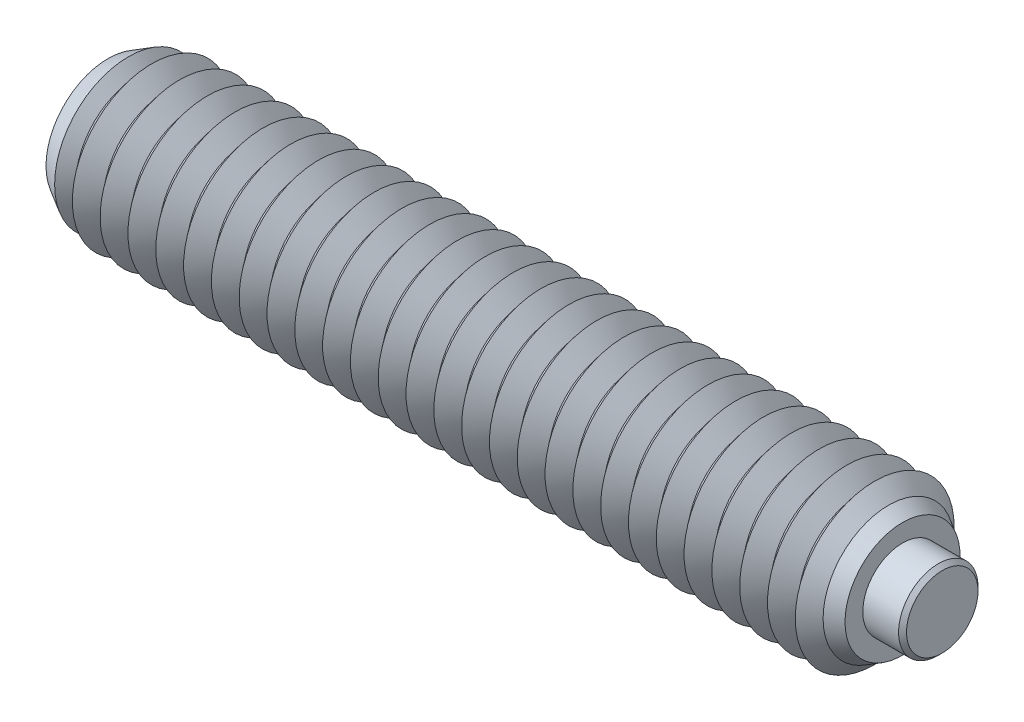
ISO-10303-21;
HEADER;
FILE_DESCRIPTION(('STEP AP214'),'2;1');
FILE_NAME('part.step','',(''),(''),'','','');
FILE_SCHEMA(('AUTOMOTIVE_DESIGN { 1 0 10303 214 1 1 1 1 }'));
ENDSEC;
DATA;
#1=APPLICATION_CONTEXT('core data for automotive mechanical design processes');
#2=APPLICATION_PROTOCOL_DEFINITION('international standard','automotive_design',2000,#1);
#3=PRODUCT_CONTEXT('',#1,'mechanical');
#4=PRODUCT('Part','Part','',(#3));
#5=PRODUCT_RELATED_PRODUCT_CATEGORY('part','',(#4));
#6=PRODUCT_DEFINITION_FORMATION('','',#4);
#7=PRODUCT_DEFINITION_CONTEXT('part definition',#1,'design');
#8=PRODUCT_DEFINITION('design','',#6,#7);
#9=PRODUCT_DEFINITION_SHAPE('','',#8);
#10=(LENGTH_UNIT() NAMED_UNIT(*) SI_UNIT(.MILLI.,.METRE.));
#11=(NAMED_UNIT(*) PLANE_ANGLE_UNIT() SI_UNIT($,.RADIAN.));
#12=(NAMED_UNIT(*) SI_UNIT($,.STERADIAN.) SOLID_ANGLE_UNIT());
#13=UNCERTAINTY_MEASURE_WITH_UNIT(LENGTH_MEASURE(1.E-05),#10,'distance_accuracy_value','');
#14=(GEOMETRIC_REPRESENTATION_CONTEXT(3) GLOBAL_UNCERTAINTY_ASSIGNED_CONTEXT((#13)) GLOBAL_UNIT_ASSIGNED_CONTEXT((#10,
#11,#12)) REPRESENTATION_CONTEXT('',''));
#15=CARTESIAN_POINT('',(0.,0.,0.));
#16=DIRECTION('',(0.,0.,1.));
#17=DIRECTION('',(1.,0.,0.));
#18=AXIS2_PLACEMENT_3D('',#15,#16,#17);
#19=CARTESIAN_POINT('',(1.35,0.,0.));
#20=DIRECTION('',(-1.,0.,0.));
#21=DIRECTION('',(0.,0.,1.));
#22=AXIS2_PLACEMENT_3D('',#19,#20,#21);
#23=CYLINDRICAL_SURFACE('',#22,1.);
#24=CARTESIAN_POINT('',(1.25,0.,0.));
#25=DIRECTION('',(1.,0.,0.));
#26=DIRECTION('',(0.,0.,-1.));
#27=AXIS2_PLACEMENT_3D('',#24,#25,#26);
#28=CIRCLE('',#27,1.);
#29=CARTESIAN_POINT('',(1.25,0.,-1.));
#30=VERTEX_POINT('',#29);
#31=EDGE_CURVE('P0_E10',#30,#30,#28,.F.);
#32=ORIENTED_EDGE('',*,*,#31,.T.);
#33=EDGE_LOOP('',(#32));
#34=FACE_BOUND('',#33,.T.);
#35=CARTESIAN_POINT('',(-0.65,0.,0.));
#36=DIRECTION('',(1.,0.,0.));
#37=DIRECTION('',(0.,0.,-1.));
#38=AXIS2_PLACEMENT_3D('',#35,#36,#37);
#39=CIRCLE('',#38,1.);
#40=CARTESIAN_POINT('',(-0.65,0.,-1.));
#41=VERTEX_POINT('',#40);
#42=EDGE_CURVE('P0_E25',#41,#41,#39,.T.);
#43=ORIENTED_EDGE('',*,*,#42,.T.);
#44=EDGE_LOOP('',(#43));
#45=FACE_BOUND('',#44,.T.);
#46=ADVANCED_FACE('P0_F14',(#34,#45),#23,.T.);
#47=CARTESIAN_POINT('',(1.35,0.,0.));
#48=DIRECTION('',(1.,0.,0.));
#49=DIRECTION('',(0.,0.,-1.));
#50=AXIS2_PLACEMENT_3D('',#47,#48,#49);
#51=PLANE('',#50);
#52=CARTESIAN_POINT('',(1.35,0.,0.));
#53=DIRECTION('',(1.,0.,0.));
#54=DIRECTION('',(0.,0.,-1.));
#55=AXIS2_PLACEMENT_3D('',#52,#53,#54);
#56=CIRCLE('',#55,0.899999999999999);
#57=CARTESIAN_POINT('',(1.35,0.,-0.899999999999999));
#58=VERTEX_POINT('',#57);
#59=EDGE_CURVE('P0_E21',#58,#58,#56,.T.);
#60=ORIENTED_EDGE('',*,*,#59,.T.);
#61=EDGE_LOOP('',(#60));
#62=FACE_BOUND('',#61,.T.);
#63=ADVANCED_FACE('P0_F35',(#62),#51,.T.);
#64=CARTESIAN_POINT('',(-0.65,0.,0.));
#65=DIRECTION('',(1.,0.,0.));
#66=DIRECTION('',(0.,0.,-1.));
#67=AXIS2_PLACEMENT_3D('',#64,#65,#66);
#68=PLANE('',#67);
#69=ORIENTED_EDGE('',*,*,#42,.F.);
#70=EDGE_LOOP('',(#69));
#71=FACE_BOUND('',#70,.T.);
#72=ADVANCED_FACE('P0_F33',(#71),#68,.F.);
#73=CARTESIAN_POINT('',(1.35,0.,0.));
#74=DIRECTION('',(-1.,0.,0.));
#75=DIRECTION('',(0.,0.,1.));
#76=AXIS2_PLACEMENT_3D('',#73,#74,#75);
#77=CONICAL_SURFACE('',#76,0.899999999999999,0.785398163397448);
#78=ORIENTED_EDGE('',*,*,#31,.F.);
#79=EDGE_LOOP('',(#78));
#80=FACE_BOUND('',#79,.T.);
#81=ORIENTED_EDGE('',*,*,#59,.F.);
#82=EDGE_LOOP('',(#81));
#83=FACE_BOUND('',#82,.T.);
#84=ADVANCED_FACE('P0_F16',(#80,#83),#77,.T.);
#85=CLOSED_SHELL('',(#46,#63,#72,#84));
#86=MANIFOLD_SOLID_BREP('P0_B1',#85);
#87=CARTESIAN_POINT('',(-19.25,0.,0.));
#88=DIRECTION('',(-1.,0.,0.));
#89=DIRECTION('',(0.,0.,1.));
#90=AXIS2_PLACEMENT_3D('',#87,#88,#89);
#91=CONICAL_SURFACE('',#90,2.,0.895664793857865);
#92=CARTESIAN_POINT('',(-18.9,0.,0.));
#93=DIRECTION('',(1.,0.,0.));
#94=DIRECTION('',(0.,0.,-1.));
#95=AXIS2_PLACEMENT_3D('',#92,#93,#94);
#96=CIRCLE('',#95,1.56285014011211);
#97=CARTESIAN_POINT('',(-18.9,0.,-1.56285014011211));
#98=VERTEX_POINT('',#97);
#99=EDGE_CURVE('P1_E1191',#98,#98,#96,.T.);
#100=ORIENTED_EDGE('',*,*,#99,.F.);
#101=EDGE_LOOP('',(#100));
#102=FACE_BOUND('',#101,.T.);
#103=CARTESIAN_POINT('',(-19.1370918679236,0.,0.));
#104=DIRECTION('',(1.,0.,0.));
#105=DIRECTION('',(0.,0.,-1.));
#106=AXIS2_PLACEMENT_3D('',#103,#104,#105);
#107=CIRCLE('',#106,1.85897778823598);
#108=CARTESIAN_POINT('',(-19.1370918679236,0.,-1.85897778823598));
#109=VERTEX_POINT('',#108);
#110=EDGE_CURVE('P1_E1194',#109,#109,#107,.F.);
#111=ORIENTED_EDGE('',*,*,#110,.F.);
#112=EDGE_LOOP('',(#111));
#113=FACE_BOUND('',#112,.T.);
#114=ADVANCED_FACE('P1_F15',(#102,#113),#91,.T.);
#115=CARTESIAN_POINT('',(-0.7,0.,0.));
#116=DIRECTION('',(1.,0.,0.));
#117=DIRECTION('',(0.,0.,-1.));
#118=AXIS2_PLACEMENT_3D('',#115,#116,#117);
#119=CONICAL_SURFACE('',#118,1.56285014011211,0.895664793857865);
#120=CARTESIAN_POINT('',(-0.35,0.,0.));
#121=DIRECTION('',(1.,0.,0.));
#122=DIRECTION('',(0.,0.,-1.));
#123=AXIS2_PLACEMENT_3D('',#120,#121,#122);
#124=CIRCLE('',#123,2.);
#125=CARTESIAN_POINT('',(-0.35,0.,2.));
#126=VERTEX_POINT('',#125);
#127=EDGE_CURVE('P1_E1031',#126,#126,#124,.T.);
#128=ORIENTED_EDGE('',*,*,#127,.F.);
#129=EDGE_LOOP('',(#128));
#130=FACE_BOUND('',#129,.T.);
#131=CARTESIAN_POINT('',(-0.7,0.,0.));
#132=DIRECTION('',(1.,0.,0.));
#133=DIRECTION('',(0.,0.,-1.));
#134=AXIS2_PLACEMENT_3D('',#131,#132,#133);
#135=CIRCLE('',#134,1.56285014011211);
#136=CARTESIAN_POINT('',(-0.7,0.,-1.56285014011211));
#137=VERTEX_POINT('',#136);
#138=EDGE_CURVE('P1_E1032',#137,#137,#135,.T.);
#139=ORIENTED_EDGE('',*,*,#138,.T.);
#140=EDGE_LOOP('',(#139));
#141=FACE_BOUND('',#140,.T.);
#142=ADVANCED_FACE('P1_F222',(#130,#141),#119,.T.);
#143=CARTESIAN_POINT('',(-1.05,0.,0.));
#144=DIRECTION('',(-1.,0.,0.));
#145=DIRECTION('',(0.,0.,1.));
#146=AXIS2_PLACEMENT_3D('',#143,#144,#145);
#147=CONICAL_SURFACE('',#146,2.,0.895664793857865);
#148=ORIENTED_EDGE('',*,*,#138,.F.);
#149=EDGE_LOOP('',(#148));
#150=FACE_BOUND('',#149,.T.);
#151=CARTESIAN_POINT('',(-1.05,0.,0.));
#152=DIRECTION('',(1.,0.,0.));
#153=DIRECTION('',(0.,0.,-1.));
#154=AXIS2_PLACEMENT_3D('',#151,#152,#153);
#155=CIRCLE('',#154,2.);
#156=CARTESIAN_POINT('',(-1.05,0.,-2.));
#157=VERTEX_POINT('',#156);
#158=EDGE_CURVE('P1_E1036',#157,#157,#155,.T.);
#159=ORIENTED_EDGE('',*,*,#158,.T.);
#160=EDGE_LOOP('',(#159));
#161=FACE_BOUND('',#160,.T.);
#162=ADVANCED_FACE('P1_F227',(#150,#161),#147,.T.);
#163=CARTESIAN_POINT('',(-0.65,0.,0.));
#164=DIRECTION('',(1.,0.,0.));
#165=DIRECTION('',(0.,1.,0.));
#166=AXIS2_PLACEMENT_3D('',#163,#164,#165);
#167=PLANE('',#166);
#168=CARTESIAN_POINT('',(-0.65,0.,0.));
#169=DIRECTION('',(1.,0.,0.));
#170=DIRECTION('',(0.,1.,0.));
#171=AXIS2_PLACEMENT_3D('',#168,#169,#170);
#172=CIRCLE('',#171,1.);
#173=CARTESIAN_POINT('',(-0.65,1.,0.));
#174=VERTEX_POINT('',#173);
#175=EDGE_CURVE('P1_E510',#174,#174,#172,.T.);
#176=ORIENTED_EDGE('',*,*,#175,.T.);
#177=EDGE_LOOP('',(#176));
#178=FACE_BOUND('',#177,.T.);
#179=ADVANCED_FACE('P1_F437',(#178),#167,.T.);
#180=CARTESIAN_POINT('',(-0.65,0.,0.));
#181=DIRECTION('',(1.,0.,0.));
#182=DIRECTION('',(0.,1.,0.));
#183=AXIS2_PLACEMENT_3D('',#180,#181,#182);
#184=CYLINDRICAL_SURFACE('',#183,1.);
#185=ORIENTED_EDGE('',*,*,#175,.F.);
#186=EDGE_LOOP('',(#185));
#187=FACE_BOUND('',#186,.T.);
#188=CARTESIAN_POINT('',(0.35,0.,0.));
#189=DIRECTION('',(1.,0.,0.));
#190=DIRECTION('',(0.,1.,0.));
#191=AXIS2_PLACEMENT_3D('',#188,#189,#190);
#192=CIRCLE('',#191,1.);
#193=CARTESIAN_POINT('',(0.35,1.,0.));
#194=VERTEX_POINT('',#193);
#195=EDGE_CURVE('P1_E513',#194,#194,#192,.T.);
#196=ORIENTED_EDGE('',*,*,#195,.T.);
#197=EDGE_LOOP('',(#196));
#198=FACE_BOUND('',#197,.T.);
#199=ADVANCED_FACE('P1_F209',(#187,#198),#184,.F.);
#200=CARTESIAN_POINT('',(0.35,1.44792740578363,0.));
#201=DIRECTION('',(1.,0.,0.));
#202=DIRECTION('',(0.,1.,0.));
#203=AXIS2_PLACEMENT_3D('',#200,#201,#202);
#204=PLANE('',#203);
#205=ORIENTED_EDGE('',*,*,#195,.F.);
#206=EDGE_LOOP('',(#205));
#207=FACE_BOUND('',#206,.T.);
#208=CARTESIAN_POINT('',(0.35,0.,0.));
#209=DIRECTION('',(1.,0.,0.));
#210=DIRECTION('',(0.,1.,0.));
#211=AXIS2_PLACEMENT_3D('',#208,#209,#210);
#212=CIRCLE('',#211,1.44792740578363);
#213=CARTESIAN_POINT('',(0.35,1.44792740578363,0.));
#214=VERTEX_POINT('',#213);
#215=EDGE_CURVE('P1_E121',#214,#214,#212,.T.);
#216=ORIENTED_EDGE('',*,*,#215,.T.);
#217=EDGE_LOOP('',(#216));
#218=FACE_BOUND('',#217,.T.);
#219=ADVANCED_FACE('P1_F206',(#207,#218),#204,.T.);
#220=CARTESIAN_POINT('',(0.35,0.,0.));
#221=DIRECTION('',(-1.,0.,0.));
#222=DIRECTION('',(0.,-1.,0.));
#223=AXIS2_PLACEMENT_3D('',#220,#221,#222);
#224=CONICAL_SURFACE('',#223,1.44792740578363,0.523598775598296);
#225=CARTESIAN_POINT('',(0.,0.,0.));
#226=DIRECTION('',(1.,0.,0.));
#227=DIRECTION('',(0.,0.,-1.));
#228=AXIS2_PLACEMENT_3D('',#225,#226,#227);
#229=CIRCLE('',#228,1.65);
#230=CARTESIAN_POINT('',(0.,0.,1.65));
#231=VERTEX_POINT('',#230);
#232=EDGE_CURVE('P1_E501',#231,#231,#229,.T.);
#233=ORIENTED_EDGE('',*,*,#232,.T.);
#234=EDGE_LOOP('',(#233));
#235=FACE_BOUND('',#234,.T.);
#236=ORIENTED_EDGE('',*,*,#215,.F.);
#237=EDGE_LOOP('',(#236));
#238=FACE_BOUND('',#237,.T.);
#239=ADVANCED_FACE('P1_F203',(#235,#238),#224,.T.);
#240=CARTESIAN_POINT('',(0.,0.,0.));
#241=DIRECTION('',(-1.,0.,0.));
#242=DIRECTION('',(0.,0.,1.));
#243=AXIS2_PLACEMENT_3D('',#240,#241,#242);
#244=CONICAL_SURFACE('',#243,1.65,0.785398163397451);
#245=CARTESIAN_POINT('',(-0.35,0.,2.));
#246=CARTESIAN_POINT('',(-0.346354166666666,0.,1.99635416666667));
#247=CARTESIAN_POINT('',(-0.342708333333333,0.,1.99270833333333));
#248=CARTESIAN_POINT('',(-0.335416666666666,0.,1.98541666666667));
#249=CARTESIAN_POINT('',(-0.331770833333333,0.,1.98177083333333));
#250=CARTESIAN_POINT('',(-0.324479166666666,0.,1.97447916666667));
#251=CARTESIAN_POINT('',(-0.320833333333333,0.,1.97083333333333));
#252=CARTESIAN_POINT('',(-0.313541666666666,0.,1.96354166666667));
#253=CARTESIAN_POINT('',(-0.309895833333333,0.,1.95989583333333));
#254=CARTESIAN_POINT('',(-0.302604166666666,0.,1.95260416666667));
#255=CARTESIAN_POINT('',(-0.298958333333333,0.,1.94895833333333));
#256=CARTESIAN_POINT('',(-0.291666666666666,0.,1.94166666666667));
#257=CARTESIAN_POINT('',(-0.288020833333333,0.,1.93802083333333));
#258=CARTESIAN_POINT('',(-0.280729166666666,0.,1.93072916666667));
#259=CARTESIAN_POINT('',(-0.277083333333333,0.,1.92708333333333));
#260=CARTESIAN_POINT('',(-0.269791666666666,0.,1.91979166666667));
#261=CARTESIAN_POINT('',(-0.266145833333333,0.,1.91614583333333));
#262=CARTESIAN_POINT('',(-0.258854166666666,0.,1.90885416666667));
#263=CARTESIAN_POINT('',(-0.255208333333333,0.,1.90520833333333));
#264=CARTESIAN_POINT('',(-0.247916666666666,0.,1.89791666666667));
#265=CARTESIAN_POINT('',(-0.244270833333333,0.,1.89427083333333));
#266=CARTESIAN_POINT('',(-0.236979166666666,0.,1.88697916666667));
#267=CARTESIAN_POINT('',(-0.233333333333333,0.,1.88333333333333));
#268=CARTESIAN_POINT('',(-0.226041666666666,0.,1.87604166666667));
#269=CARTESIAN_POINT('',(-0.222395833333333,0.,1.87239583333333));
#270=CARTESIAN_POINT('',(-0.215104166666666,0.,1.86510416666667));
#271=CARTESIAN_POINT('',(-0.211458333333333,0.,1.86145833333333));
#272=CARTESIAN_POINT('',(-0.204166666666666,0.,1.85416666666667));
#273=CARTESIAN_POINT('',(-0.200520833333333,0.,1.85052083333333));
#274=CARTESIAN_POINT('',(-0.193229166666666,0.,1.84322916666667));
#275=CARTESIAN_POINT('',(-0.189583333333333,0.,1.83958333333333));
#276=CARTESIAN_POINT('',(-0.182291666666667,0.,1.83229166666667));
#277=CARTESIAN_POINT('',(-0.178645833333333,0.,1.82864583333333));
#278=CARTESIAN_POINT('',(-0.171354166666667,0.,1.82135416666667));
#279=CARTESIAN_POINT('',(-0.167708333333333,0.,1.81770833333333));
#280=CARTESIAN_POINT('',(-0.160416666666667,0.,1.81041666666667));
#281=CARTESIAN_POINT('',(-0.156770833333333,0.,1.80677083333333));
#282=CARTESIAN_POINT('',(-0.149479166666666,0.,1.79947916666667));
#283=CARTESIAN_POINT('',(-0.145833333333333,0.,1.79583333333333));
#284=CARTESIAN_POINT('',(-0.138541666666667,0.,1.78854166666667));
#285=CARTESIAN_POINT('',(-0.134895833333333,0.,1.78489583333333));
#286=CARTESIAN_POINT('',(-0.127604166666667,0.,1.77760416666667));
#287=CARTESIAN_POINT('',(-0.123958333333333,0.,1.77395833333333));
#288=CARTESIAN_POINT('',(-0.116666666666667,0.,1.76666666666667));
#289=CARTESIAN_POINT('',(-0.113020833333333,0.,1.76302083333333));
#290=CARTESIAN_POINT('',(-0.105729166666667,0.,1.75572916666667));
#291=CARTESIAN_POINT('',(-0.102083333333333,0.,1.75208333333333));
#292=CARTESIAN_POINT('',(-0.0947916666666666,0.,1.74479166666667));
#293=CARTESIAN_POINT('',(-0.0911458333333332,0.,1.74114583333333));
#294=CARTESIAN_POINT('',(-0.0838541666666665,0.,1.73385416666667));
#295=CARTESIAN_POINT('',(-0.0802083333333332,0.,1.73020833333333));
#296=CARTESIAN_POINT('',(-0.0729166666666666,0.,1.72291666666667));
#297=CARTESIAN_POINT('',(-0.0692708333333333,0.,1.71927083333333));
#298=CARTESIAN_POINT('',(-0.0619791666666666,0.,1.71197916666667));
#299=CARTESIAN_POINT('',(-0.0583333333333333,0.,1.70833333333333));
#300=CARTESIAN_POINT('',(-0.0510416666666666,0.,1.70104166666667));
#301=CARTESIAN_POINT('',(-0.0473958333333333,0.,1.69739583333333));
#302=CARTESIAN_POINT('',(-0.0401041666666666,0.,1.69010416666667));
#303=CARTESIAN_POINT('',(-0.0364583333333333,0.,1.68645833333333));
#304=CARTESIAN_POINT('',(-0.0291666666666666,0.,1.67916666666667));
#305=CARTESIAN_POINT('',(-0.0255208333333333,0.,1.67552083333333));
#306=CARTESIAN_POINT('',(-0.0182291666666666,0.,1.66822916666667));
#307=CARTESIAN_POINT('',(-0.0145833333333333,0.,1.66458333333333));
#308=CARTESIAN_POINT('',(-0.00729166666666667,0.,1.65729166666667));
#309=CARTESIAN_POINT('',(-0.00364583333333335,0.,1.65364583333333));
#310=CARTESIAN_POINT('',(0.,0.,1.65));
#311=B_SPLINE_CURVE_WITH_KNOTS('',3,(#245,#246,#247,#248,#249,#250,#251,#252,#253,#254,#255,
#256,#257,#258,#259,#260,#261,#262,#263,#264,#265,#266,#267,#268,#269,#270,#271,#272,#273,#274,
#275,#276,#277,#278,#279,#280,#281,#282,#283,#284,#285,#286,#287,#288,#289,#290,#291,#292,#293,
#294,#295,#296,#297,#298,#299,#300,#301,#302,#303,#304,#305,#306,#307,#308,#309,#310),
.UNSPECIFIED.,.F.,.F.,(4,2,2,2,2,2,2,2,2,2,2,2,2,2,2,2,2,2,2,2,2,2,2,2,2,2,2,2,2,2,2,2,4),(0.,
0.0154679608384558,0.0309359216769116,0.0464038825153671,0.0618718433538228,0.0773398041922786,
0.0928077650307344,0.10827572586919,0.123743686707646,0.139211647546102,0.154679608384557,
0.170147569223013,0.185615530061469,0.201083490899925,0.21655145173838,0.232019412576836,
0.247487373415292,0.262955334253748,0.278423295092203,0.293891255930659,0.309359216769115,
0.324827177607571,0.340295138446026,0.355763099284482,0.371231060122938,0.386699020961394,
0.40216698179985,0.417634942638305,0.433102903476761,0.448570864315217,0.464038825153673,
0.479506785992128,0.494974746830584),.UNSPECIFIED.);
#312=EDGE_CURVE('P1_BSEAM17',#126,#231,#311,.T.);
#313=ORIENTED_EDGE('',*,*,#127,.T.);
#314=ORIENTED_EDGE('',*,*,#232,.F.);
#315=ORIENTED_EDGE('',*,*,#312,.T.);
#316=ORIENTED_EDGE('',*,*,#312,.F.);
#317=EDGE_LOOP('',(#313,#315,#314,#316));
#318=FACE_BOUND('',#317,.T.);
#319=ADVANCED_FACE('P1_F17',(#318),#244,.T.);
#320=CARTESIAN_POINT('',(-1.4,0.,0.));
#321=DIRECTION('',(1.,0.,0.));
#322=DIRECTION('',(0.,0.,-1.));
#323=AXIS2_PLACEMENT_3D('',#320,#321,#322);
#324=CONICAL_SURFACE('',#323,1.56285014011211,0.895664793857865);
#325=ORIENTED_EDGE('',*,*,#158,.F.);
#326=EDGE_LOOP('',(#325));
#327=FACE_BOUND('',#326,.T.);
#328=CARTESIAN_POINT('',(-1.4,0.,0.));
#329=DIRECTION('',(1.,0.,0.));
#330=DIRECTION('',(0.,0.,-1.));
#331=AXIS2_PLACEMENT_3D('',#328,#329,#330);
#332=CIRCLE('',#331,1.56285014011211);
#333=CARTESIAN_POINT('',(-1.4,0.,-1.56285014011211));
#334=VERTEX_POINT('',#333);
#335=EDGE_CURVE('P1_E1041',#334,#334,#332,.T.);
#336=ORIENTED_EDGE('',*,*,#335,.T.);
#337=EDGE_LOOP('',(#336));
#338=FACE_BOUND('',#337,.T.);
#339=ADVANCED_FACE('P1_F431',(#327,#338),#324,.T.);
#340=CARTESIAN_POINT('',(-1.75,0.,0.));
#341=DIRECTION('',(-1.,0.,0.));
#342=DIRECTION('',(0.,0.,1.));
#343=AXIS2_PLACEMENT_3D('',#340,#341,#342);
#344=CONICAL_SURFACE('',#343,2.,0.895664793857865);
#345=ORIENTED_EDGE('',*,*,#335,.F.);
#346=EDGE_LOOP('',(#345));
#347=FACE_BOUND('',#346,.T.);
#348=CARTESIAN_POINT('',(-1.75,0.,0.));
#349=DIRECTION('',(1.,0.,0.));
#350=DIRECTION('',(0.,0.,-1.));
#351=AXIS2_PLACEMENT_3D('',#348,#349,#350);
#352=CIRCLE('',#351,2.);
#353=CARTESIAN_POINT('',(-1.75,0.,-2.));
#354=VERTEX_POINT('',#353);
#355=EDGE_CURVE('P1_E1044',#354,#354,#352,.T.);
#356=ORIENTED_EDGE('',*,*,#355,.T.);
#357=EDGE_LOOP('',(#356));
#358=FACE_BOUND('',#357,.T.);
#359=ADVANCED_FACE('P1_F427',(#347,#358),#344,.T.);
#360=CARTESIAN_POINT('',(-2.1,0.,0.));
#361=DIRECTION('',(1.,0.,0.));
#362=DIRECTION('',(0.,0.,-1.));
#363=AXIS2_PLACEMENT_3D('',#360,#361,#362);
#364=CONICAL_SURFACE('',#363,1.56285014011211,0.895664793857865);
#365=ORIENTED_EDGE('',*,*,#355,.F.);
#366=EDGE_LOOP('',(#365));
#367=FACE_BOUND('',#366,.T.);
#368=CARTESIAN_POINT('',(-2.1,0.,0.));
#369=DIRECTION('',(1.,0.,0.));
#370=DIRECTION('',(0.,0.,-1.));
#371=AXIS2_PLACEMENT_3D('',#368,#369,#370);
#372=CIRCLE('',#371,1.56285014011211);
#373=CARTESIAN_POINT('',(-2.1,0.,-1.56285014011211));
#374=VERTEX_POINT('',#373);
#375=EDGE_CURVE('P1_E1047',#374,#374,#372,.T.);
#376=ORIENTED_EDGE('',*,*,#375,.T.);
#377=EDGE_LOOP('',(#376));
#378=FACE_BOUND('',#377,.T.);
#379=ADVANCED_FACE('P1_F423',(#367,#378),#364,.T.);
#380=CARTESIAN_POINT('',(-2.45,0.,0.));
#381=DIRECTION('',(-1.,0.,0.));
#382=DIRECTION('',(0.,0.,1.));
#383=AXIS2_PLACEMENT_3D('',#380,#381,#382);
#384=CONICAL_SURFACE('',#383,2.,0.895664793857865);
#385=ORIENTED_EDGE('',*,*,#375,.F.);
#386=EDGE_LOOP('',(#385));
#387=FACE_BOUND('',#386,.T.);
#388=CARTESIAN_POINT('',(-2.45,0.,0.));
#389=DIRECTION('',(1.,0.,0.));
#390=DIRECTION('',(0.,0.,-1.));
#391=AXIS2_PLACEMENT_3D('',#388,#389,#390);
#392=CIRCLE('',#391,2.);
#393=CARTESIAN_POINT('',(-2.45,0.,-2.));
#394=VERTEX_POINT('',#393);
#395=EDGE_CURVE('P1_E1050',#394,#394,#392,.T.);
#396=ORIENTED_EDGE('',*,*,#395,.T.);
#397=EDGE_LOOP('',(#396));
#398=FACE_BOUND('',#397,.T.);
#399=ADVANCED_FACE('P1_F419',(#387,#398),#384,.T.);
#400=CARTESIAN_POINT('',(-2.8,0.,0.));
#401=DIRECTION('',(1.,0.,0.));
#402=DIRECTION('',(0.,0.,-1.));
#403=AXIS2_PLACEMENT_3D('',#400,#401,#402);
#404=CONICAL_SURFACE('',#403,1.56285014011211,0.895664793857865);
#405=ORIENTED_EDGE('',*,*,#395,.F.);
#406=EDGE_LOOP('',(#405));
#407=FACE_BOUND('',#406,.T.);
#408=CARTESIAN_POINT('',(-2.8,0.,0.));
#409=DIRECTION('',(1.,0.,0.));
#410=DIRECTION('',(0.,0.,-1.));
#411=AXIS2_PLACEMENT_3D('',#408,#409,#410);
#412=CIRCLE('',#411,1.56285014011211);
#413=CARTESIAN_POINT('',(-2.8,0.,-1.56285014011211));
#414=VERTEX_POINT('',#413);
#415=EDGE_CURVE('P1_E1053',#414,#414,#412,.T.);
#416=ORIENTED_EDGE('',*,*,#415,.T.);
#417=EDGE_LOOP('',(#416));
#418=FACE_BOUND('',#417,.T.);
#419=ADVANCED_FACE('P1_F415',(#407,#418),#404,.T.);
#420=CARTESIAN_POINT('',(-3.15,0.,0.));
#421=DIRECTION('',(-1.,0.,0.));
#422=DIRECTION('',(0.,0.,1.));
#423=AXIS2_PLACEMENT_3D('',#420,#421,#422);
#424=CONICAL_SURFACE('',#423,2.,0.895664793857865);
#425=ORIENTED_EDGE('',*,*,#415,.F.);
#426=EDGE_LOOP('',(#425));
#427=FACE_BOUND('',#426,.T.);
#428=CARTESIAN_POINT('',(-3.15,0.,0.));
#429=DIRECTION('',(1.,0.,0.));
#430=DIRECTION('',(0.,0.,-1.));
#431=AXIS2_PLACEMENT_3D('',#428,#429,#430);
#432=CIRCLE('',#431,2.);
#433=CARTESIAN_POINT('',(-3.15,0.,-2.));
#434=VERTEX_POINT('',#433);
#435=EDGE_CURVE('P1_E1056',#434,#434,#432,.T.);
#436=ORIENTED_EDGE('',*,*,#435,.T.);
#437=EDGE_LOOP('',(#436));
#438=FACE_BOUND('',#437,.T.);
#439=ADVANCED_FACE('P1_F411',(#427,#438),#424,.T.);
#440=CARTESIAN_POINT('',(-3.5,0.,0.));
#441=DIRECTION('',(1.,0.,0.));
#442=DIRECTION('',(0.,0.,-1.));
#443=AXIS2_PLACEMENT_3D('',#440,#441,#442);
#444=CONICAL_SURFACE('',#443,1.56285014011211,0.895664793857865);
#445=ORIENTED_EDGE('',*,*,#435,.F.);
#446=EDGE_LOOP('',(#445));
#447=FACE_BOUND('',#446,.T.);
#448=CARTESIAN_POINT('',(-3.5,0.,0.));
#449=DIRECTION('',(1.,0.,0.));
#450=DIRECTION('',(0.,0.,-1.));
#451=AXIS2_PLACEMENT_3D('',#448,#449,#450);
#452=CIRCLE('',#451,1.56285014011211);
#453=CARTESIAN_POINT('',(-3.5,0.,-1.56285014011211));
#454=VERTEX_POINT('',#453);
#455=EDGE_CURVE('P1_E1059',#454,#454,#452,.T.);
#456=ORIENTED_EDGE('',*,*,#455,.T.);
#457=EDGE_LOOP('',(#456));
#458=FACE_BOUND('',#457,.T.);
#459=ADVANCED_FACE('P1_F407',(#447,#458),#444,.T.);
#460=CARTESIAN_POINT('',(-3.85,0.,0.));
#461=DIRECTION('',(-1.,0.,0.));
#462=DIRECTION('',(0.,0.,1.));
#463=AXIS2_PLACEMENT_3D('',#460,#461,#462);
#464=CONICAL_SURFACE('',#463,2.,0.895664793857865);
#465=ORIENTED_EDGE('',*,*,#455,.F.);
#466=EDGE_LOOP('',(#465));
#467=FACE_BOUND('',#466,.T.);
#468=CARTESIAN_POINT('',(-3.85,0.,0.));
#469=DIRECTION('',(1.,0.,0.));
#470=DIRECTION('',(0.,0.,-1.));
#471=AXIS2_PLACEMENT_3D('',#468,#469,#470);
#472=CIRCLE('',#471,2.);
#473=CARTESIAN_POINT('',(-3.85,0.,-2.));
#474=VERTEX_POINT('',#473);
#475=EDGE_CURVE('P1_E1062',#474,#474,#472,.T.);
#476=ORIENTED_EDGE('',*,*,#475,.T.);
#477=EDGE_LOOP('',(#476));
#478=FACE_BOUND('',#477,.T.);
#479=ADVANCED_FACE('P1_F403',(#467,#478),#464,.T.);
#480=CARTESIAN_POINT('',(-4.2,0.,0.));
#481=DIRECTION('',(1.,0.,0.));
#482=DIRECTION('',(0.,0.,-1.));
#483=AXIS2_PLACEMENT_3D('',#480,#481,#482);
#484=CONICAL_SURFACE('',#483,1.56285014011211,0.895664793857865);
#485=ORIENTED_EDGE('',*,*,#475,.F.);
#486=EDGE_LOOP('',(#485));
#487=FACE_BOUND('',#486,.T.);
#488=CARTESIAN_POINT('',(-4.2,0.,0.));
#489=DIRECTION('',(1.,0.,0.));
#490=DIRECTION('',(0.,0.,-1.));
#491=AXIS2_PLACEMENT_3D('',#488,#489,#490);
#492=CIRCLE('',#491,1.56285014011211);
#493=CARTESIAN_POINT('',(-4.2,0.,-1.56285014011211));
#494=VERTEX_POINT('',#493);
#495=EDGE_CURVE('P1_E1065',#494,#494,#492,.T.);
#496=ORIENTED_EDGE('',*,*,#495,.T.);
#497=EDGE_LOOP('',(#496));
#498=FACE_BOUND('',#497,.T.);
#499=ADVANCED_FACE('P1_F399',(#487,#498),#484,.T.);
#500=CARTESIAN_POINT('',(-4.55,0.,0.));
#501=DIRECTION('',(-1.,0.,0.));
#502=DIRECTION('',(0.,0.,1.));
#503=AXIS2_PLACEMENT_3D('',#500,#501,#502);
#504=CONICAL_SURFACE('',#503,2.,0.895664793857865);
#505=ORIENTED_EDGE('',*,*,#495,.F.);
#506=EDGE_LOOP('',(#505));
#507=FACE_BOUND('',#506,.T.);
#508=CARTESIAN_POINT('',(-4.55,0.,0.));
#509=DIRECTION('',(1.,0.,0.));
#510=DIRECTION('',(0.,0.,-1.));
#511=AXIS2_PLACEMENT_3D('',#508,#509,#510);
#512=CIRCLE('',#511,2.);
#513=CARTESIAN_POINT('',(-4.55,0.,-2.));
#514=VERTEX_POINT('',#513);
#515=EDGE_CURVE('P1_E1068',#514,#514,#512,.T.);
#516=ORIENTED_EDGE('',*,*,#515,.T.);
#517=EDGE_LOOP('',(#516));
#518=FACE_BOUND('',#517,.T.);
#519=ADVANCED_FACE('P1_F395',(#507,#518),#504,.T.);
#520=CARTESIAN_POINT('',(-4.9,0.,0.));
#521=DIRECTION('',(1.,0.,0.));
#522=DIRECTION('',(0.,0.,-1.));
#523=AXIS2_PLACEMENT_3D('',#520,#521,#522);
#524=CONICAL_SURFACE('',#523,1.56285014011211,0.895664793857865);
#525=ORIENTED_EDGE('',*,*,#515,.F.);
#526=EDGE_LOOP('',(#525));
#527=FACE_BOUND('',#526,.T.);
#528=CARTESIAN_POINT('',(-4.9,0.,0.));
#529=DIRECTION('',(1.,0.,0.));
#530=DIRECTION('',(0.,0.,-1.));
#531=AXIS2_PLACEMENT_3D('',#528,#529,#530);
#532=CIRCLE('',#531,1.56285014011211);
#533=CARTESIAN_POINT('',(-4.9,0.,-1.56285014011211));
#534=VERTEX_POINT('',#533);
#535=EDGE_CURVE('P1_E1071',#534,#534,#532,.T.);
#536=ORIENTED_EDGE('',*,*,#535,.T.);
#537=EDGE_LOOP('',(#536));
#538=FACE_BOUND('',#537,.T.);
#539=ADVANCED_FACE('P1_F391',(#527,#538),#524,.T.);
#540=CARTESIAN_POINT('',(-5.25,0.,0.));
#541=DIRECTION('',(-1.,0.,0.));
#542=DIRECTION('',(0.,0.,1.));
#543=AXIS2_PLACEMENT_3D('',#540,#541,#542);
#544=CONICAL_SURFACE('',#543,2.,0.895664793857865);
#545=ORIENTED_EDGE('',*,*,#535,.F.);
#546=EDGE_LOOP('',(#545));
#547=FACE_BOUND('',#546,.T.);
#548=CARTESIAN_POINT('',(-5.25,0.,0.));
#549=DIRECTION('',(1.,0.,0.));
#550=DIRECTION('',(0.,0.,-1.));
#551=AXIS2_PLACEMENT_3D('',#548,#549,#550);
#552=CIRCLE('',#551,2.);
#553=CARTESIAN_POINT('',(-5.25,0.,-2.));
#554=VERTEX_POINT('',#553);
#555=EDGE_CURVE('P1_E1074',#554,#554,#552,.T.);
#556=ORIENTED_EDGE('',*,*,#555,.T.);
#557=EDGE_LOOP('',(#556));
#558=FACE_BOUND('',#557,.T.);
#559=ADVANCED_FACE('P1_F387',(#547,#558),#544,.T.);
#560=CARTESIAN_POINT('',(-5.6,0.,0.));
#561=DIRECTION('',(1.,0.,0.));
#562=DIRECTION('',(0.,0.,-1.));
#563=AXIS2_PLACEMENT_3D('',#560,#561,#562);
#564=CONICAL_SURFACE('',#563,1.56285014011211,0.895664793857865);
#565=ORIENTED_EDGE('',*,*,#555,.F.);
#566=EDGE_LOOP('',(#565));
#567=FACE_BOUND('',#566,.T.);
#568=CARTESIAN_POINT('',(-5.6,0.,0.));
#569=DIRECTION('',(1.,0.,0.));
#570=DIRECTION('',(0.,0.,-1.));
#571=AXIS2_PLACEMENT_3D('',#568,#569,#570);
#572=CIRCLE('',#571,1.56285014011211);
#573=CARTESIAN_POINT('',(-5.6,0.,-1.56285014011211));
#574=VERTEX_POINT('',#573);
#575=EDGE_CURVE('P1_E1077',#574,#574,#572,.T.);
#576=ORIENTED_EDGE('',*,*,#575,.T.);
#577=EDGE_LOOP('',(#576));
#578=FACE_BOUND('',#577,.T.);
#579=ADVANCED_FACE('P1_F383',(#567,#578),#564,.T.);
#580=CARTESIAN_POINT('',(-5.95,0.,0.));
#581=DIRECTION('',(-1.,0.,0.));
#582=DIRECTION('',(0.,0.,1.));
#583=AXIS2_PLACEMENT_3D('',#580,#581,#582);
#584=CONICAL_SURFACE('',#583,2.,0.895664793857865);
#585=ORIENTED_EDGE('',*,*,#575,.F.);
#586=EDGE_LOOP('',(#585));
#587=FACE_BOUND('',#586,.T.);
#588=CARTESIAN_POINT('',(-5.95,0.,0.));
#589=DIRECTION('',(1.,0.,0.));
#590=DIRECTION('',(0.,0.,-1.));
#591=AXIS2_PLACEMENT_3D('',#588,#589,#590);
#592=CIRCLE('',#591,2.);
#593=CARTESIAN_POINT('',(-5.95,0.,-2.));
#594=VERTEX_POINT('',#593);
#595=EDGE_CURVE('P1_E1080',#594,#594,#592,.T.);
#596=ORIENTED_EDGE('',*,*,#595,.T.);
#597=EDGE_LOOP('',(#596));
#598=FACE_BOUND('',#597,.T.);
#599=ADVANCED_FACE('P1_F379',(#587,#598),#584,.T.);
#600=CARTESIAN_POINT('',(-6.3,0.,0.));
#601=DIRECTION('',(1.,0.,0.));
#602=DIRECTION('',(0.,0.,-1.));
#603=AXIS2_PLACEMENT_3D('',#600,#601,#602);
#604=CONICAL_SURFACE('',#603,1.56285014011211,0.895664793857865);
#605=ORIENTED_EDGE('',*,*,#595,.F.);
#606=EDGE_LOOP('',(#605));
#607=FACE_BOUND('',#606,.T.);
#608=CARTESIAN_POINT('',(-6.3,0.,0.));
#609=DIRECTION('',(1.,0.,0.));
#610=DIRECTION('',(0.,0.,-1.));
#611=AXIS2_PLACEMENT_3D('',#608,#609,#610);
#612=CIRCLE('',#611,1.56285014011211);
#613=CARTESIAN_POINT('',(-6.3,0.,-1.56285014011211));
#614=VERTEX_POINT('',#613);
#615=EDGE_CURVE('P1_E1083',#614,#614,#612,.T.);
#616=ORIENTED_EDGE('',*,*,#615,.T.);
#617=EDGE_LOOP('',(#616));
#618=FACE_BOUND('',#617,.T.);
#619=ADVANCED_FACE('P1_F375',(#607,#618),#604,.T.);
#620=CARTESIAN_POINT('',(-6.65,0.,0.));
#621=DIRECTION('',(-1.,0.,0.));
#622=DIRECTION('',(0.,0.,1.));
#623=AXIS2_PLACEMENT_3D('',#620,#621,#622);
#624=CONICAL_SURFACE('',#623,2.,0.895664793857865);
#625=ORIENTED_EDGE('',*,*,#615,.F.);
#626=EDGE_LOOP('',(#625));
#627=FACE_BOUND('',#626,.T.);
#628=CARTESIAN_POINT('',(-6.65,0.,0.));
#629=DIRECTION('',(1.,0.,0.));
#630=DIRECTION('',(0.,0.,-1.));
#631=AXIS2_PLACEMENT_3D('',#628,#629,#630);
#632=CIRCLE('',#631,2.);
#633=CARTESIAN_POINT('',(-6.65,0.,-2.));
#634=VERTEX_POINT('',#633);
#635=EDGE_CURVE('P1_E1086',#634,#634,#632,.T.);
#636=ORIENTED_EDGE('',*,*,#635,.T.);
#637=EDGE_LOOP('',(#636));
#638=FACE_BOUND('',#637,.T.);
#639=ADVANCED_FACE('P1_F371',(#627,#638),#624,.T.);
#640=CARTESIAN_POINT('',(-7.,0.,0.));
#641=DIRECTION('',(1.,0.,0.));
#642=DIRECTION('',(0.,0.,-1.));
#643=AXIS2_PLACEMENT_3D('',#640,#641,#642);
#644=CONICAL_SURFACE('',#643,1.56285014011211,0.895664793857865);
#645=ORIENTED_EDGE('',*,*,#635,.F.);
#646=EDGE_LOOP('',(#645));
#647=FACE_BOUND('',#646,.T.);
#648=CARTESIAN_POINT('',(-7.,0.,0.));
#649=DIRECTION('',(1.,0.,0.));
#650=DIRECTION('',(0.,0.,-1.));
#651=AXIS2_PLACEMENT_3D('',#648,#649,#650);
#652=CIRCLE('',#651,1.56285014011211);
#653=CARTESIAN_POINT('',(-7.,0.,-1.56285014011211));
#654=VERTEX_POINT('',#653);
#655=EDGE_CURVE('P1_E1089',#654,#654,#652,.T.);
#656=ORIENTED_EDGE('',*,*,#655,.T.);
#657=EDGE_LOOP('',(#656));
#658=FACE_BOUND('',#657,.T.);
#659=ADVANCED_FACE('P1_F367',(#647,#658),#644,.T.);
#660=CARTESIAN_POINT('',(-7.35,0.,0.));
#661=DIRECTION('',(-1.,0.,0.));
#662=DIRECTION('',(0.,0.,1.));
#663=AXIS2_PLACEMENT_3D('',#660,#661,#662);
#664=CONICAL_SURFACE('',#663,2.,0.895664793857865);
#665=ORIENTED_EDGE('',*,*,#655,.F.);
#666=EDGE_LOOP('',(#665));
#667=FACE_BOUND('',#666,.T.);
#668=CARTESIAN_POINT('',(-7.35,0.,0.));
#669=DIRECTION('',(1.,0.,0.));
#670=DIRECTION('',(0.,0.,-1.));
#671=AXIS2_PLACEMENT_3D('',#668,#669,#670);
#672=CIRCLE('',#671,2.);
#673=CARTESIAN_POINT('',(-7.35,0.,-2.));
#674=VERTEX_POINT('',#673);
#675=EDGE_CURVE('P1_E1092',#674,#674,#672,.T.);
#676=ORIENTED_EDGE('',*,*,#675,.T.);
#677=EDGE_LOOP('',(#676));
#678=FACE_BOUND('',#677,.T.);
#679=ADVANCED_FACE('P1_F363',(#667,#678),#664,.T.);
#680=CARTESIAN_POINT('',(-7.7,0.,0.));
#681=DIRECTION('',(1.,0.,0.));
#682=DIRECTION('',(0.,0.,-1.));
#683=AXIS2_PLACEMENT_3D('',#680,#681,#682);
#684=CONICAL_SURFACE('',#683,1.56285014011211,0.895664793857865);
#685=ORIENTED_EDGE('',*,*,#675,.F.);
#686=EDGE_LOOP('',(#685));
#687=FACE_BOUND('',#686,.T.);
#688=CARTESIAN_POINT('',(-7.7,0.,0.));
#689=DIRECTION('',(1.,0.,0.));
#690=DIRECTION('',(0.,0.,-1.));
#691=AXIS2_PLACEMENT_3D('',#688,#689,#690);
#692=CIRCLE('',#691,1.56285014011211);
#693=CARTESIAN_POINT('',(-7.7,0.,-1.56285014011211));
#694=VERTEX_POINT('',#693);
#695=EDGE_CURVE('P1_E1095',#694,#694,#692,.T.);
#696=ORIENTED_EDGE('',*,*,#695,.T.);
#697=EDGE_LOOP('',(#696));
#698=FACE_BOUND('',#697,.T.);
#699=ADVANCED_FACE('P1_F359',(#687,#698),#684,.T.);
#700=CARTESIAN_POINT('',(-8.05,0.,0.));
#701=DIRECTION('',(-1.,0.,0.));
#702=DIRECTION('',(0.,0.,1.));
#703=AXIS2_PLACEMENT_3D('',#700,#701,#702);
#704=CONICAL_SURFACE('',#703,2.,0.895664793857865);
#705=ORIENTED_EDGE('',*,*,#695,.F.);
#706=EDGE_LOOP('',(#705));
#707=FACE_BOUND('',#706,.T.);
#708=CARTESIAN_POINT('',(-8.05,0.,0.));
#709=DIRECTION('',(1.,0.,0.));
#710=DIRECTION('',(0.,0.,-1.));
#711=AXIS2_PLACEMENT_3D('',#708,#709,#710);
#712=CIRCLE('',#711,2.);
#713=CARTESIAN_POINT('',(-8.05,0.,-2.));
#714=VERTEX_POINT('',#713);
#715=EDGE_CURVE('P1_E1098',#714,#714,#712,.T.);
#716=ORIENTED_EDGE('',*,*,#715,.T.);
#717=EDGE_LOOP('',(#716));
#718=FACE_BOUND('',#717,.T.);
#719=ADVANCED_FACE('P1_F355',(#707,#718),#704,.T.);
#720=CARTESIAN_POINT('',(-8.4,0.,0.));
#721=DIRECTION('',(1.,0.,0.));
#722=DIRECTION('',(0.,0.,-1.));
#723=AXIS2_PLACEMENT_3D('',#720,#721,#722);
#724=CONICAL_SURFACE('',#723,1.56285014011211,0.895664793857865);
#725=ORIENTED_EDGE('',*,*,#715,.F.);
#726=EDGE_LOOP('',(#725));
#727=FACE_BOUND('',#726,.T.);
#728=CARTESIAN_POINT('',(-8.4,0.,0.));
#729=DIRECTION('',(1.,0.,0.));
#730=DIRECTION('',(0.,0.,-1.));
#731=AXIS2_PLACEMENT_3D('',#728,#729,#730);
#732=CIRCLE('',#731,1.56285014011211);
#733=CARTESIAN_POINT('',(-8.4,0.,-1.56285014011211));
#734=VERTEX_POINT('',#733);
#735=EDGE_CURVE('P1_E1101',#734,#734,#732,.T.);
#736=ORIENTED_EDGE('',*,*,#735,.T.);
#737=EDGE_LOOP('',(#736));
#738=FACE_BOUND('',#737,.T.);
#739=ADVANCED_FACE('P1_F351',(#727,#738),#724,.T.);
#740=CARTESIAN_POINT('',(-8.75,0.,0.));
#741=DIRECTION('',(-1.,0.,0.));
#742=DIRECTION('',(0.,0.,1.));
#743=AXIS2_PLACEMENT_3D('',#740,#741,#742);
#744=CONICAL_SURFACE('',#743,2.,0.895664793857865);
#745=ORIENTED_EDGE('',*,*,#735,.F.);
#746=EDGE_LOOP('',(#745));
#747=FACE_BOUND('',#746,.T.);
#748=CARTESIAN_POINT('',(-8.75,0.,0.));
#749=DIRECTION('',(1.,0.,0.));
#750=DIRECTION('',(0.,0.,-1.));
#751=AXIS2_PLACEMENT_3D('',#748,#749,#750);
#752=CIRCLE('',#751,2.);
#753=CARTESIAN_POINT('',(-8.75,0.,-2.));
#754=VERTEX_POINT('',#753);
#755=EDGE_CURVE('P1_E1104',#754,#754,#752,.T.);
#756=ORIENTED_EDGE('',*,*,#755,.T.);
#757=EDGE_LOOP('',(#756));
#758=FACE_BOUND('',#757,.T.);
#759=ADVANCED_FACE('P1_F347',(#747,#758),#744,.T.);
#760=CARTESIAN_POINT('',(-9.1,0.,0.));
#761=DIRECTION('',(1.,0.,0.));
#762=DIRECTION('',(0.,0.,-1.));
#763=AXIS2_PLACEMENT_3D('',#760,#761,#762);
#764=CONICAL_SURFACE('',#763,1.56285014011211,0.895664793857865);
#765=ORIENTED_EDGE('',*,*,#755,.F.);
#766=EDGE_LOOP('',(#765));
#767=FACE_BOUND('',#766,.T.);
#768=CARTESIAN_POINT('',(-9.1,0.,0.));
#769=DIRECTION('',(1.,0.,0.));
#770=DIRECTION('',(0.,0.,-1.));
#771=AXIS2_PLACEMENT_3D('',#768,#769,#770);
#772=CIRCLE('',#771,1.56285014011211);
#773=CARTESIAN_POINT('',(-9.1,0.,-1.56285014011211));
#774=VERTEX_POINT('',#773);
#775=EDGE_CURVE('P1_E1107',#774,#774,#772,.T.);
#776=ORIENTED_EDGE('',*,*,#775,.T.);
#777=EDGE_LOOP('',(#776));
#778=FACE_BOUND('',#777,.T.);
#779=ADVANCED_FACE('P1_F343',(#767,#778),#764,.T.);
#780=CARTESIAN_POINT('',(-9.45,0.,0.));
#781=DIRECTION('',(-1.,0.,0.));
#782=DIRECTION('',(0.,0.,1.));
#783=AXIS2_PLACEMENT_3D('',#780,#781,#782);
#784=CONICAL_SURFACE('',#783,2.,0.895664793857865);
#785=ORIENTED_EDGE('',*,*,#775,.F.);
#786=EDGE_LOOP('',(#785));
#787=FACE_BOUND('',#786,.T.);
#788=CARTESIAN_POINT('',(-9.45,0.,0.));
#789=DIRECTION('',(1.,0.,0.));
#790=DIRECTION('',(0.,0.,-1.));
#791=AXIS2_PLACEMENT_3D('',#788,#789,#790);
#792=CIRCLE('',#791,2.);
#793=CARTESIAN_POINT('',(-9.45,0.,-2.));
#794=VERTEX_POINT('',#793);
#795=EDGE_CURVE('P1_E1110',#794,#794,#792,.T.);
#796=ORIENTED_EDGE('',*,*,#795,.T.);
#797=EDGE_LOOP('',(#796));
#798=FACE_BOUND('',#797,.T.);
#799=ADVANCED_FACE('P1_F339',(#787,#798),#784,.T.);
#800=CARTESIAN_POINT('',(-9.8,0.,0.));
#801=DIRECTION('',(1.,0.,0.));
#802=DIRECTION('',(0.,0.,-1.));
#803=AXIS2_PLACEMENT_3D('',#800,#801,#802);
#804=CONICAL_SURFACE('',#803,1.56285014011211,0.895664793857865);
#805=ORIENTED_EDGE('',*,*,#795,.F.);
#806=EDGE_LOOP('',(#805));
#807=FACE_BOUND('',#806,.T.);
#808=CARTESIAN_POINT('',(-9.8,0.,0.));
#809=DIRECTION('',(1.,0.,0.));
#810=DIRECTION('',(0.,0.,-1.));
#811=AXIS2_PLACEMENT_3D('',#808,#809,#810);
#812=CIRCLE('',#811,1.56285014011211);
#813=CARTESIAN_POINT('',(-9.8,0.,-1.56285014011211));
#814=VERTEX_POINT('',#813);
#815=EDGE_CURVE('P1_E1113',#814,#814,#812,.T.);
#816=ORIENTED_EDGE('',*,*,#815,.T.);
#817=EDGE_LOOP('',(#816));
#818=FACE_BOUND('',#817,.T.);
#819=ADVANCED_FACE('P1_F335',(#807,#818),#804,.T.);
#820=CARTESIAN_POINT('',(-10.15,0.,0.));
#821=DIRECTION('',(-1.,0.,0.));
#822=DIRECTION('',(0.,0.,1.));
#823=AXIS2_PLACEMENT_3D('',#820,#821,#822);
#824=CONICAL_SURFACE('',#823,2.,0.895664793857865);
#825=ORIENTED_EDGE('',*,*,#815,.F.);
#826=EDGE_LOOP('',(#825));
#827=FACE_BOUND('',#826,.T.);
#828=CARTESIAN_POINT('',(-10.15,0.,0.));
#829=DIRECTION('',(1.,0.,0.));
#830=DIRECTION('',(0.,0.,-1.));
#831=AXIS2_PLACEMENT_3D('',#828,#829,#830);
#832=CIRCLE('',#831,2.);
#833=CARTESIAN_POINT('',(-10.15,0.,-2.));
#834=VERTEX_POINT('',#833);
#835=EDGE_CURVE('P1_E1116',#834,#834,#832,.T.);
#836=ORIENTED_EDGE('',*,*,#835,.T.);
#837=EDGE_LOOP('',(#836));
#838=FACE_BOUND('',#837,.T.);
#839=ADVANCED_FACE('P1_F331',(#827,#838),#824,.T.);
#840=CARTESIAN_POINT('',(-10.5,0.,0.));
#841=DIRECTION('',(1.,0.,0.));
#842=DIRECTION('',(0.,0.,-1.));
#843=AXIS2_PLACEMENT_3D('',#840,#841,#842);
#844=CONICAL_SURFACE('',#843,1.56285014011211,0.895664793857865);
#845=ORIENTED_EDGE('',*,*,#835,.F.);
#846=EDGE_LOOP('',(#845));
#847=FACE_BOUND('',#846,.T.);
#848=CARTESIAN_POINT('',(-10.5,0.,0.));
#849=DIRECTION('',(1.,0.,0.));
#850=DIRECTION('',(0.,0.,-1.));
#851=AXIS2_PLACEMENT_3D('',#848,#849,#850);
#852=CIRCLE('',#851,1.56285014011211);
#853=CARTESIAN_POINT('',(-10.5,0.,-1.56285014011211));
#854=VERTEX_POINT('',#853);
#855=EDGE_CURVE('P1_E1119',#854,#854,#852,.T.);
#856=ORIENTED_EDGE('',*,*,#855,.T.);
#857=EDGE_LOOP('',(#856));
#858=FACE_BOUND('',#857,.T.);
#859=ADVANCED_FACE('P1_F327',(#847,#858),#844,.T.);
#860=CARTESIAN_POINT('',(-10.85,0.,0.));
#861=DIRECTION('',(-1.,0.,0.));
#862=DIRECTION('',(0.,0.,1.));
#863=AXIS2_PLACEMENT_3D('',#860,#861,#862);
#864=CONICAL_SURFACE('',#863,2.,0.895664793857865);
#865=ORIENTED_EDGE('',*,*,#855,.F.);
#866=EDGE_LOOP('',(#865));
#867=FACE_BOUND('',#866,.T.);
#868=CARTESIAN_POINT('',(-10.85,0.,0.));
#869=DIRECTION('',(1.,0.,0.));
#870=DIRECTION('',(0.,0.,-1.));
#871=AXIS2_PLACEMENT_3D('',#868,#869,#870);
#872=CIRCLE('',#871,2.);
#873=CARTESIAN_POINT('',(-10.85,0.,-2.));
#874=VERTEX_POINT('',#873);
#875=EDGE_CURVE('P1_E1122',#874,#874,#872,.T.);
#876=ORIENTED_EDGE('',*,*,#875,.T.);
#877=EDGE_LOOP('',(#876));
#878=FACE_BOUND('',#877,.T.);
#879=ADVANCED_FACE('P1_F323',(#867,#878),#864,.T.);
#880=CARTESIAN_POINT('',(-11.2,0.,0.));
#881=DIRECTION('',(1.,0.,0.));
#882=DIRECTION('',(0.,0.,-1.));
#883=AXIS2_PLACEMENT_3D('',#880,#881,#882);
#884=CONICAL_SURFACE('',#883,1.56285014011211,0.895664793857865);
#885=ORIENTED_EDGE('',*,*,#875,.F.);
#886=EDGE_LOOP('',(#885));
#887=FACE_BOUND('',#886,.T.);
#888=CARTESIAN_POINT('',(-11.2,0.,0.));
#889=DIRECTION('',(1.,0.,0.));
#890=DIRECTION('',(0.,0.,-1.));
#891=AXIS2_PLACEMENT_3D('',#888,#889,#890);
#892=CIRCLE('',#891,1.56285014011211);
#893=CARTESIAN_POINT('',(-11.2,0.,-1.56285014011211));
#894=VERTEX_POINT('',#893);
#895=EDGE_CURVE('P1_E1125',#894,#894,#892,.T.);
#896=ORIENTED_EDGE('',*,*,#895,.T.);
#897=EDGE_LOOP('',(#896));
#898=FACE_BOUND('',#897,.T.);
#899=ADVANCED_FACE('P1_F319',(#887,#898),#884,.T.);
#900=CARTESIAN_POINT('',(-11.55,0.,0.));
#901=DIRECTION('',(-1.,0.,0.));
#902=DIRECTION('',(0.,0.,1.));
#903=AXIS2_PLACEMENT_3D('',#900,#901,#902);
#904=CONICAL_SURFACE('',#903,2.,0.895664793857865);
#905=ORIENTED_EDGE('',*,*,#895,.F.);
#906=EDGE_LOOP('',(#905));
#907=FACE_BOUND('',#906,.T.);
#908=CARTESIAN_POINT('',(-11.55,0.,0.));
#909=DIRECTION('',(1.,0.,0.));
#910=DIRECTION('',(0.,0.,-1.));
#911=AXIS2_PLACEMENT_3D('',#908,#909,#910);
#912=CIRCLE('',#911,2.);
#913=CARTESIAN_POINT('',(-11.55,0.,-2.));
#914=VERTEX_POINT('',#913);
#915=EDGE_CURVE('P1_E1128',#914,#914,#912,.T.);
#916=ORIENTED_EDGE('',*,*,#915,.T.);
#917=EDGE_LOOP('',(#916));
#918=FACE_BOUND('',#917,.T.);
#919=ADVANCED_FACE('P1_F315',(#907,#918),#904,.T.);
#920=CARTESIAN_POINT('',(-11.9,0.,0.));
#921=DIRECTION('',(1.,0.,0.));
#922=DIRECTION('',(0.,0.,-1.));
#923=AXIS2_PLACEMENT_3D('',#920,#921,#922);
#924=CONICAL_SURFACE('',#923,1.56285014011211,0.895664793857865);
#925=ORIENTED_EDGE('',*,*,#915,.F.);
#926=EDGE_LOOP('',(#925));
#927=FACE_BOUND('',#926,.T.);
#928=CARTESIAN_POINT('',(-11.9,0.,0.));
#929=DIRECTION('',(1.,0.,0.));
#930=DIRECTION('',(0.,0.,-1.));
#931=AXIS2_PLACEMENT_3D('',#928,#929,#930);
#932=CIRCLE('',#931,1.56285014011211);
#933=CARTESIAN_POINT('',(-11.9,0.,-1.56285014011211));
#934=VERTEX_POINT('',#933);
#935=EDGE_CURVE('P1_E1131',#934,#934,#932,.T.);
#936=ORIENTED_EDGE('',*,*,#935,.T.);
#937=EDGE_LOOP('',(#936));
#938=FACE_BOUND('',#937,.T.);
#939=ADVANCED_FACE('P1_F311',(#927,#938),#924,.T.);
#940=CARTESIAN_POINT('',(-12.25,0.,0.));
#941=DIRECTION('',(-1.,0.,0.));
#942=DIRECTION('',(0.,0.,1.));
#943=AXIS2_PLACEMENT_3D('',#940,#941,#942);
#944=CONICAL_SURFACE('',#943,2.,0.895664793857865);
#945=ORIENTED_EDGE('',*,*,#935,.F.);
#946=EDGE_LOOP('',(#945));
#947=FACE_BOUND('',#946,.T.);
#948=CARTESIAN_POINT('',(-12.25,0.,0.));
#949=DIRECTION('',(1.,0.,0.));
#950=DIRECTION('',(0.,0.,-1.));
#951=AXIS2_PLACEMENT_3D('',#948,#949,#950);
#952=CIRCLE('',#951,2.);
#953=CARTESIAN_POINT('',(-12.25,0.,-2.));
#954=VERTEX_POINT('',#953);
#955=EDGE_CURVE('P1_E1134',#954,#954,#952,.T.);
#956=ORIENTED_EDGE('',*,*,#955,.T.);
#957=EDGE_LOOP('',(#956));
#958=FACE_BOUND('',#957,.T.);
#959=ADVANCED_FACE('P1_F307',(#947,#958),#944,.T.);
#960=CARTESIAN_POINT('',(-12.6,0.,0.));
#961=DIRECTION('',(1.,0.,0.));
#962=DIRECTION('',(0.,0.,-1.));
#963=AXIS2_PLACEMENT_3D('',#960,#961,#962);
#964=CONICAL_SURFACE('',#963,1.56285014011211,0.895664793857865);
#965=ORIENTED_EDGE('',*,*,#955,.F.);
#966=EDGE_LOOP('',(#965));
#967=FACE_BOUND('',#966,.T.);
#968=CARTESIAN_POINT('',(-12.6,0.,0.));
#969=DIRECTION('',(1.,0.,0.));
#970=DIRECTION('',(0.,0.,-1.));
#971=AXIS2_PLACEMENT_3D('',#968,#969,#970);
#972=CIRCLE('',#971,1.56285014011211);
#973=CARTESIAN_POINT('',(-12.6,0.,-1.56285014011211));
#974=VERTEX_POINT('',#973);
#975=EDGE_CURVE('P1_E1137',#974,#974,#972,.T.);
#976=ORIENTED_EDGE('',*,*,#975,.T.);
#977=EDGE_LOOP('',(#976));
#978=FACE_BOUND('',#977,.T.);
#979=ADVANCED_FACE('P1_F303',(#967,#978),#964,.T.);
#980=CARTESIAN_POINT('',(-12.95,0.,0.));
#981=DIRECTION('',(-1.,0.,0.));
#982=DIRECTION('',(0.,0.,1.));
#983=AXIS2_PLACEMENT_3D('',#980,#981,#982);
#984=CONICAL_SURFACE('',#983,2.,0.895664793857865);
#985=ORIENTED_EDGE('',*,*,#975,.F.);
#986=EDGE_LOOP('',(#985));
#987=FACE_BOUND('',#986,.T.);
#988=CARTESIAN_POINT('',(-12.95,0.,0.));
#989=DIRECTION('',(1.,0.,0.));
#990=DIRECTION('',(0.,0.,-1.));
#991=AXIS2_PLACEMENT_3D('',#988,#989,#990);
#992=CIRCLE('',#991,2.);
#993=CARTESIAN_POINT('',(-12.95,0.,-2.));
#994=VERTEX_POINT('',#993);
#995=EDGE_CURVE('P1_E1140',#994,#994,#992,.T.);
#996=ORIENTED_EDGE('',*,*,#995,.T.);
#997=EDGE_LOOP('',(#996));
#998=FACE_BOUND('',#997,.T.);
#999=ADVANCED_FACE('P1_F299',(#987,#998),#984,.T.);
#1000=CARTESIAN_POINT('',(-13.3,0.,0.));
#1001=DIRECTION('',(1.,0.,0.));
#1002=DIRECTION('',(0.,0.,-1.));
#1003=AXIS2_PLACEMENT_3D('',#1000,#1001,#1002);
#1004=CONICAL_SURFACE('',#1003,1.56285014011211,0.895664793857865);
#1005=ORIENTED_EDGE('',*,*,#995,.F.);
#1006=EDGE_LOOP('',(#1005));
#1007=FACE_BOUND('',#1006,.T.);
#1008=CARTESIAN_POINT('',(-13.3,0.,0.));
#1009=DIRECTION('',(1.,0.,0.));
#1010=DIRECTION('',(0.,0.,-1.));
#1011=AXIS2_PLACEMENT_3D('',#1008,#1009,#1010);
#1012=CIRCLE('',#1011,1.56285014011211);
#1013=CARTESIAN_POINT('',(-13.3,0.,-1.56285014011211));
#1014=VERTEX_POINT('',#1013);
#1015=EDGE_CURVE('P1_E1143',#1014,#1014,#1012,.T.);
#1016=ORIENTED_EDGE('',*,*,#1015,.T.);
#1017=EDGE_LOOP('',(#1016));
#1018=FACE_BOUND('',#1017,.T.);
#1019=ADVANCED_FACE('P1_F295',(#1007,#1018),#1004,.T.);
#1020=CARTESIAN_POINT('',(-13.65,0.,0.));
#1021=DIRECTION('',(-1.,0.,0.));
#1022=DIRECTION('',(0.,0.,1.));
#1023=AXIS2_PLACEMENT_3D('',#1020,#1021,#1022);
#1024=CONICAL_SURFACE('',#1023,2.,0.895664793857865);
#1025=ORIENTED_EDGE('',*,*,#1015,.F.);
#1026=EDGE_LOOP('',(#1025));
#1027=FACE_BOUND('',#1026,.T.);
#1028=CARTESIAN_POINT('',(-13.65,0.,0.));
#1029=DIRECTION('',(1.,0.,0.));
#1030=DIRECTION('',(0.,0.,-1.));
#1031=AXIS2_PLACEMENT_3D('',#1028,#1029,#1030);
#1032=CIRCLE('',#1031,2.);
#1033=CARTESIAN_POINT('',(-13.65,0.,-2.));
#1034=VERTEX_POINT('',#1033);
#1035=EDGE_CURVE('P1_E1146',#1034,#1034,#1032,.T.);
#1036=ORIENTED_EDGE('',*,*,#1035,.T.);
#1037=EDGE_LOOP('',(#1036));
#1038=FACE_BOUND('',#1037,.T.);
#1039=ADVANCED_FACE('P1_F291',(#1027,#1038),#1024,.T.);
#1040=CARTESIAN_POINT('',(-14.,0.,0.));
#1041=DIRECTION('',(1.,0.,0.));
#1042=DIRECTION('',(0.,0.,-1.));
#1043=AXIS2_PLACEMENT_3D('',#1040,#1041,#1042);
#1044=CONICAL_SURFACE('',#1043,1.56285014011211,0.895664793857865);
#1045=ORIENTED_EDGE('',*,*,#1035,.F.);
#1046=EDGE_LOOP('',(#1045));
#1047=FACE_BOUND('',#1046,.T.);
#1048=CARTESIAN_POINT('',(-14.,0.,0.));
#1049=DIRECTION('',(1.,0.,0.));
#1050=DIRECTION('',(0.,0.,-1.));
#1051=AXIS2_PLACEMENT_3D('',#1048,#1049,#1050);
#1052=CIRCLE('',#1051,1.56285014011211);
#1053=CARTESIAN_POINT('',(-14.,0.,-1.56285014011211));
#1054=VERTEX_POINT('',#1053);
#1055=EDGE_CURVE('P1_E1149',#1054,#1054,#1052,.T.);
#1056=ORIENTED_EDGE('',*,*,#1055,.T.);
#1057=EDGE_LOOP('',(#1056));
#1058=FACE_BOUND('',#1057,.T.);
#1059=ADVANCED_FACE('P1_F287',(#1047,#1058),#1044,.T.);
#1060=CARTESIAN_POINT('',(-14.35,0.,0.));
#1061=DIRECTION('',(-1.,0.,0.));
#1062=DIRECTION('',(0.,0.,1.));
#1063=AXIS2_PLACEMENT_3D('',#1060,#1061,#1062);
#1064=CONICAL_SURFACE('',#1063,2.,0.895664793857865);
#1065=ORIENTED_EDGE('',*,*,#1055,.F.);
#1066=EDGE_LOOP('',(#1065));
#1067=FACE_BOUND('',#1066,.T.);
#1068=CARTESIAN_POINT('',(-14.35,0.,0.));
#1069=DIRECTION('',(1.,0.,0.));
#1070=DIRECTION('',(0.,0.,-1.));
#1071=AXIS2_PLACEMENT_3D('',#1068,#1069,#1070);
#1072=CIRCLE('',#1071,2.);
#1073=CARTESIAN_POINT('',(-14.35,0.,-2.));
#1074=VERTEX_POINT('',#1073);
#1075=EDGE_CURVE('P1_E1152',#1074,#1074,#1072,.T.);
#1076=ORIENTED_EDGE('',*,*,#1075,.T.);
#1077=EDGE_LOOP('',(#1076));
#1078=FACE_BOUND('',#1077,.T.);
#1079=ADVANCED_FACE('P1_F283',(#1067,#1078),#1064,.T.);
#1080=CARTESIAN_POINT('',(-14.7,0.,0.));
#1081=DIRECTION('',(1.,0.,0.));
#1082=DIRECTION('',(0.,0.,-1.));
#1083=AXIS2_PLACEMENT_3D('',#1080,#1081,#1082);
#1084=CONICAL_SURFACE('',#1083,1.56285014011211,0.895664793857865);
#1085=ORIENTED_EDGE('',*,*,#1075,.F.);
#1086=EDGE_LOOP('',(#1085));
#1087=FACE_BOUND('',#1086,.T.);
#1088=CARTESIAN_POINT('',(-14.7,0.,0.));
#1089=DIRECTION('',(1.,0.,0.));
#1090=DIRECTION('',(0.,0.,-1.));
#1091=AXIS2_PLACEMENT_3D('',#1088,#1089,#1090);
#1092=CIRCLE('',#1091,1.56285014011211);
#1093=CARTESIAN_POINT('',(-14.7,0.,-1.56285014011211));
#1094=VERTEX_POINT('',#1093);
#1095=EDGE_CURVE('P1_E1155',#1094,#1094,#1092,.T.);
#1096=ORIENTED_EDGE('',*,*,#1095,.T.);
#1097=EDGE_LOOP('',(#1096));
#1098=FACE_BOUND('',#1097,.T.);
#1099=ADVANCED_FACE('P1_F279',(#1087,#1098),#1084,.T.);
#1100=CARTESIAN_POINT('',(-15.05,0.,0.));
#1101=DIRECTION('',(-1.,0.,0.));
#1102=DIRECTION('',(0.,0.,1.));
#1103=AXIS2_PLACEMENT_3D('',#1100,#1101,#1102);
#1104=CONICAL_SURFACE('',#1103,2.,0.895664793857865);
#1105=ORIENTED_EDGE('',*,*,#1095,.F.);
#1106=EDGE_LOOP('',(#1105));
#1107=FACE_BOUND('',#1106,.T.);
#1108=CARTESIAN_POINT('',(-15.05,0.,0.));
#1109=DIRECTION('',(1.,0.,0.));
#1110=DIRECTION('',(0.,0.,-1.));
#1111=AXIS2_PLACEMENT_3D('',#1108,#1109,#1110);
#1112=CIRCLE('',#1111,2.);
#1113=CARTESIAN_POINT('',(-15.05,0.,-2.));
#1114=VERTEX_POINT('',#1113);
#1115=EDGE_CURVE('P1_E1158',#1114,#1114,#1112,.T.);
#1116=ORIENTED_EDGE('',*,*,#1115,.T.);
#1117=EDGE_LOOP('',(#1116));
#1118=FACE_BOUND('',#1117,.T.);
#1119=ADVANCED_FACE('P1_F275',(#1107,#1118),#1104,.T.);
#1120=CARTESIAN_POINT('',(-15.4,0.,0.));
#1121=DIRECTION('',(1.,0.,0.));
#1122=DIRECTION('',(0.,0.,-1.));
#1123=AXIS2_PLACEMENT_3D('',#1120,#1121,#1122);
#1124=CONICAL_SURFACE('',#1123,1.56285014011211,0.895664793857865);
#1125=ORIENTED_EDGE('',*,*,#1115,.F.);
#1126=EDGE_LOOP('',(#1125));
#1127=FACE_BOUND('',#1126,.T.);
#1128=CARTESIAN_POINT('',(-15.4,0.,0.));
#1129=DIRECTION('',(1.,0.,0.));
#1130=DIRECTION('',(0.,0.,-1.));
#1131=AXIS2_PLACEMENT_3D('',#1128,#1129,#1130);
#1132=CIRCLE('',#1131,1.56285014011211);
#1133=CARTESIAN_POINT('',(-15.4,0.,-1.56285014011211));
#1134=VERTEX_POINT('',#1133);
#1135=EDGE_CURVE('P1_E1161',#1134,#1134,#1132,.T.);
#1136=ORIENTED_EDGE('',*,*,#1135,.T.);
#1137=EDGE_LOOP('',(#1136));
#1138=FACE_BOUND('',#1137,.T.);
#1139=ADVANCED_FACE('P1_F271',(#1127,#1138),#1124,.T.);
#1140=CARTESIAN_POINT('',(-15.75,0.,0.));
#1141=DIRECTION('',(-1.,0.,0.));
#1142=DIRECTION('',(0.,0.,1.));
#1143=AXIS2_PLACEMENT_3D('',#1140,#1141,#1142);
#1144=CONICAL_SURFACE('',#1143,2.,0.895664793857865);
#1145=ORIENTED_EDGE('',*,*,#1135,.F.);
#1146=EDGE_LOOP('',(#1145));
#1147=FACE_BOUND('',#1146,.T.);
#1148=CARTESIAN_POINT('',(-15.75,0.,0.));
#1149=DIRECTION('',(1.,0.,0.));
#1150=DIRECTION('',(0.,0.,-1.));
#1151=AXIS2_PLACEMENT_3D('',#1148,#1149,#1150);
#1152=CIRCLE('',#1151,2.);
#1153=CARTESIAN_POINT('',(-15.75,0.,-2.));
#1154=VERTEX_POINT('',#1153);
#1155=EDGE_CURVE('P1_E1164',#1154,#1154,#1152,.T.);
#1156=ORIENTED_EDGE('',*,*,#1155,.T.);
#1157=EDGE_LOOP('',(#1156));
#1158=FACE_BOUND('',#1157,.T.);
#1159=ADVANCED_FACE('P1_F267',(#1147,#1158),#1144,.T.);
#1160=CARTESIAN_POINT('',(-16.1,0.,0.));
#1161=DIRECTION('',(1.,0.,0.));
#1162=DIRECTION('',(0.,0.,-1.));
#1163=AXIS2_PLACEMENT_3D('',#1160,#1161,#1162);
#1164=CONICAL_SURFACE('',#1163,1.56285014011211,0.895664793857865);
#1165=ORIENTED_EDGE('',*,*,#1155,.F.);
#1166=EDGE_LOOP('',(#1165));
#1167=FACE_BOUND('',#1166,.T.);
#1168=CARTESIAN_POINT('',(-16.1,0.,0.));
#1169=DIRECTION('',(1.,0.,0.));
#1170=DIRECTION('',(0.,0.,-1.));
#1171=AXIS2_PLACEMENT_3D('',#1168,#1169,#1170);
#1172=CIRCLE('',#1171,1.56285014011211);
#1173=CARTESIAN_POINT('',(-16.1,0.,-1.56285014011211));
#1174=VERTEX_POINT('',#1173);
#1175=EDGE_CURVE('P1_E1167',#1174,#1174,#1172,.T.);
#1176=ORIENTED_EDGE('',*,*,#1175,.T.);
#1177=EDGE_LOOP('',(#1176));
#1178=FACE_BOUND('',#1177,.T.);
#1179=ADVANCED_FACE('P1_F263',(#1167,#1178),#1164,.T.);
#1180=CARTESIAN_POINT('',(-16.45,0.,0.));
#1181=DIRECTION('',(-1.,0.,0.));
#1182=DIRECTION('',(0.,0.,1.));
#1183=AXIS2_PLACEMENT_3D('',#1180,#1181,#1182);
#1184=CONICAL_SURFACE('',#1183,2.,0.895664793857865);
#1185=ORIENTED_EDGE('',*,*,#1175,.F.);
#1186=EDGE_LOOP('',(#1185));
#1187=FACE_BOUND('',#1186,.T.);
#1188=CARTESIAN_POINT('',(-16.45,0.,0.));
#1189=DIRECTION('',(1.,0.,0.));
#1190=DIRECTION('',(0.,0.,-1.));
#1191=AXIS2_PLACEMENT_3D('',#1188,#1189,#1190);
#1192=CIRCLE('',#1191,2.);
#1193=CARTESIAN_POINT('',(-16.45,0.,-2.));
#1194=VERTEX_POINT('',#1193);
#1195=EDGE_CURVE('P1_E1170',#1194,#1194,#1192,.T.);
#1196=ORIENTED_EDGE('',*,*,#1195,.T.);
#1197=EDGE_LOOP('',(#1196));
#1198=FACE_BOUND('',#1197,.T.);
#1199=ADVANCED_FACE('P1_F259',(#1187,#1198),#1184,.T.);
#1200=CARTESIAN_POINT('',(-16.8,0.,0.));
#1201=DIRECTION('',(1.,0.,0.));
#1202=DIRECTION('',(0.,0.,-1.));
#1203=AXIS2_PLACEMENT_3D('',#1200,#1201,#1202);
#1204=CONICAL_SURFACE('',#1203,1.56285014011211,0.895664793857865);
#1205=ORIENTED_EDGE('',*,*,#1195,.F.);
#1206=EDGE_LOOP('',(#1205));
#1207=FACE_BOUND('',#1206,.T.);
#1208=CARTESIAN_POINT('',(-16.8,0.,0.));
#1209=DIRECTION('',(1.,0.,0.));
#1210=DIRECTION('',(0.,0.,-1.));
#1211=AXIS2_PLACEMENT_3D('',#1208,#1209,#1210);
#1212=CIRCLE('',#1211,1.56285014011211);
#1213=CARTESIAN_POINT('',(-16.8,0.,-1.56285014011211));
#1214=VERTEX_POINT('',#1213);
#1215=EDGE_CURVE('P1_E1173',#1214,#1214,#1212,.T.);
#1216=ORIENTED_EDGE('',*,*,#1215,.T.);
#1217=EDGE_LOOP('',(#1216));
#1218=FACE_BOUND('',#1217,.T.);
#1219=ADVANCED_FACE('P1_F255',(#1207,#1218),#1204,.T.);
#1220=CARTESIAN_POINT('',(-17.15,0.,0.));
#1221=DIRECTION('',(-1.,0.,0.));
#1222=DIRECTION('',(0.,0.,1.));
#1223=AXIS2_PLACEMENT_3D('',#1220,#1221,#1222);
#1224=CONICAL_SURFACE('',#1223,2.,0.895664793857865);
#1225=ORIENTED_EDGE('',*,*,#1215,.F.);
#1226=EDGE_LOOP('',(#1225));
#1227=FACE_BOUND('',#1226,.T.);
#1228=CARTESIAN_POINT('',(-17.15,0.,0.));
#1229=DIRECTION('',(1.,0.,0.));
#1230=DIRECTION('',(0.,0.,-1.));
#1231=AXIS2_PLACEMENT_3D('',#1228,#1229,#1230);
#1232=CIRCLE('',#1231,2.);
#1233=CARTESIAN_POINT('',(-17.15,0.,-2.));
#1234=VERTEX_POINT('',#1233);
#1235=EDGE_CURVE('P1_E1176',#1234,#1234,#1232,.T.);
#1236=ORIENTED_EDGE('',*,*,#1235,.T.);
#1237=EDGE_LOOP('',(#1236));
#1238=FACE_BOUND('',#1237,.T.);
#1239=ADVANCED_FACE('P1_F251',(#1227,#1238),#1224,.T.);
#1240=CARTESIAN_POINT('',(-17.5,0.,0.));
#1241=DIRECTION('',(1.,0.,0.));
#1242=DIRECTION('',(0.,0.,-1.));
#1243=AXIS2_PLACEMENT_3D('',#1240,#1241,#1242);
#1244=CONICAL_SURFACE('',#1243,1.56285014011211,0.895664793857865);
#1245=ORIENTED_EDGE('',*,*,#1235,.F.);
#1246=EDGE_LOOP('',(#1245));
#1247=FACE_BOUND('',#1246,.T.);
#1248=CARTESIAN_POINT('',(-17.5,0.,0.));
#1249=DIRECTION('',(1.,0.,0.));
#1250=DIRECTION('',(0.,0.,-1.));
#1251=AXIS2_PLACEMENT_3D('',#1248,#1249,#1250);
#1252=CIRCLE('',#1251,1.56285014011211);
#1253=CARTESIAN_POINT('',(-17.5,0.,-1.56285014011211));
#1254=VERTEX_POINT('',#1253);
#1255=EDGE_CURVE('P1_E1179',#1254,#1254,#1252,.T.);
#1256=ORIENTED_EDGE('',*,*,#1255,.T.);
#1257=EDGE_LOOP('',(#1256));
#1258=FACE_BOUND('',#1257,.T.);
#1259=ADVANCED_FACE('P1_F247',(#1247,#1258),#1244,.T.);
#1260=CARTESIAN_POINT('',(-17.85,0.,0.));
#1261=DIRECTION('',(-1.,0.,0.));
#1262=DIRECTION('',(0.,0.,1.));
#1263=AXIS2_PLACEMENT_3D('',#1260,#1261,#1262);
#1264=CONICAL_SURFACE('',#1263,2.,0.895664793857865);
#1265=ORIENTED_EDGE('',*,*,#1255,.F.);
#1266=EDGE_LOOP('',(#1265));
#1267=FACE_BOUND('',#1266,.T.);
#1268=CARTESIAN_POINT('',(-17.85,0.,0.));
#1269=DIRECTION('',(1.,0.,0.));
#1270=DIRECTION('',(0.,0.,-1.));
#1271=AXIS2_PLACEMENT_3D('',#1268,#1269,#1270);
#1272=CIRCLE('',#1271,2.);
#1273=CARTESIAN_POINT('',(-17.85,0.,-2.));
#1274=VERTEX_POINT('',#1273);
#1275=EDGE_CURVE('P1_E1182',#1274,#1274,#1272,.T.);
#1276=ORIENTED_EDGE('',*,*,#1275,.T.);
#1277=EDGE_LOOP('',(#1276));
#1278=FACE_BOUND('',#1277,.T.);
#1279=ADVANCED_FACE('P1_F243',(#1267,#1278),#1264,.T.);
#1280=CARTESIAN_POINT('',(-18.2,0.,0.));
#1281=DIRECTION('',(1.,0.,0.));
#1282=DIRECTION('',(0.,0.,-1.));
#1283=AXIS2_PLACEMENT_3D('',#1280,#1281,#1282);
#1284=CONICAL_SURFACE('',#1283,1.56285014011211,0.895664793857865);
#1285=ORIENTED_EDGE('',*,*,#1275,.F.);
#1286=EDGE_LOOP('',(#1285));
#1287=FACE_BOUND('',#1286,.T.);
#1288=CARTESIAN_POINT('',(-18.2,0.,0.));
#1289=DIRECTION('',(1.,0.,0.));
#1290=DIRECTION('',(0.,0.,-1.));
#1291=AXIS2_PLACEMENT_3D('',#1288,#1289,#1290);
#1292=CIRCLE('',#1291,1.56285014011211);
#1293=CARTESIAN_POINT('',(-18.2,0.,-1.56285014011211));
#1294=VERTEX_POINT('',#1293);
#1295=EDGE_CURVE('P1_E1185',#1294,#1294,#1292,.T.);
#1296=ORIENTED_EDGE('',*,*,#1295,.T.);
#1297=EDGE_LOOP('',(#1296));
#1298=FACE_BOUND('',#1297,.T.);
#1299=ADVANCED_FACE('P1_F239',(#1287,#1298),#1284,.T.);
#1300=CARTESIAN_POINT('',(-18.55,0.,0.));
#1301=DIRECTION('',(-1.,0.,0.));
#1302=DIRECTION('',(0.,0.,1.));
#1303=AXIS2_PLACEMENT_3D('',#1300,#1301,#1302);
#1304=CONICAL_SURFACE('',#1303,2.,0.895664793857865);
#1305=ORIENTED_EDGE('',*,*,#1295,.F.);
#1306=EDGE_LOOP('',(#1305));
#1307=FACE_BOUND('',#1306,.T.);
#1308=CARTESIAN_POINT('',(-18.55,0.,0.));
#1309=DIRECTION('',(1.,0.,0.));
#1310=DIRECTION('',(0.,0.,-1.));
#1311=AXIS2_PLACEMENT_3D('',#1308,#1309,#1310);
#1312=CIRCLE('',#1311,2.);
#1313=CARTESIAN_POINT('',(-18.55,0.,-2.));
#1314=VERTEX_POINT('',#1313);
#1315=EDGE_CURVE('P1_E1188',#1314,#1314,#1312,.T.);
#1316=ORIENTED_EDGE('',*,*,#1315,.T.);
#1317=EDGE_LOOP('',(#1316));
#1318=FACE_BOUND('',#1317,.T.);
#1319=ADVANCED_FACE('P1_F235',(#1307,#1318),#1304,.T.);
#1320=CARTESIAN_POINT('',(-18.9,0.,0.));
#1321=DIRECTION('',(1.,0.,0.));
#1322=DIRECTION('',(0.,0.,-1.));
#1323=AXIS2_PLACEMENT_3D('',#1320,#1321,#1322);
#1324=CONICAL_SURFACE('',#1323,1.56285014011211,0.895664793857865);
#1325=ORIENTED_EDGE('',*,*,#1315,.F.);
#1326=EDGE_LOOP('',(#1325));
#1327=FACE_BOUND('',#1326,.T.);
#1328=ORIENTED_EDGE('',*,*,#99,.T.);
#1329=EDGE_LOOP('',(#1328));
#1330=FACE_BOUND('',#1329,.T.);
#1331=ADVANCED_FACE('P1_F219',(#1327,#1330),#1324,.T.);
#1332=CARTESIAN_POINT('',(-19.65,0.,0.));
#1333=DIRECTION('',(1.,0.,0.));
#1334=DIRECTION('',(0.,0.,1.));
#1335=AXIS2_PLACEMENT_3D('',#1332,#1333,#1334);
#1336=CONICAL_SURFACE('',#1335,1.56285014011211,0.5235987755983);
#1337=CARTESIAN_POINT('',(-19.65,0.,0.));
#1338=DIRECTION('',(-1.,0.,0.));
#1339=DIRECTION('',(0.,0.,1.));
#1340=AXIS2_PLACEMENT_3D('',#1337,#1338,#1339);
#1341=CIRCLE('',#1340,1.56285014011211);
#1342=CARTESIAN_POINT('',(-19.65,0.,1.56285014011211));
#1343=VERTEX_POINT('',#1342);
#1344=EDGE_CURVE('P1_E1196',#1343,#1343,#1341,.T.);
#1345=ORIENTED_EDGE('',*,*,#1344,.F.);
#1346=EDGE_LOOP('',(#1345));
#1347=FACE_BOUND('',#1346,.T.);
#1348=ORIENTED_EDGE('',*,*,#110,.T.);
#1349=EDGE_LOOP('',(#1348));
#1350=FACE_BOUND('',#1349,.T.);
#1351=ADVANCED_FACE('P1_F159',(#1347,#1350),#1336,.T.);
#1352=CARTESIAN_POINT('',(-19.65,0.,0.));
#1353=DIRECTION('',(1.,0.,0.));
#1354=DIRECTION('',(0.,0.,-1.));
#1355=AXIS2_PLACEMENT_3D('',#1352,#1353,#1354);
#1356=PLANE('',#1355);
#1357=CARTESIAN_POINT('',(-19.65,0.,0.));
#1358=DIRECTION('',(1.,0.,0.));
#1359=DIRECTION('',(0.,0.,-1.));
#1360=AXIS2_PLACEMENT_3D('',#1357,#1358,#1359);
#1361=CIRCLE('',#1360,1.15470053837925);
#1362=CARTESIAN_POINT('',(-19.65,-1.,-0.577350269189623));
#1363=VERTEX_POINT('',#1362);
#1364=CARTESIAN_POINT('',(-19.65,0.,-1.15470053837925));
#1365=VERTEX_POINT('',#1364);
#1366=EDGE_CURVE('P1_E19',#1363,#1365,#1361,.T.);
#1367=ORIENTED_EDGE('',*,*,#1366,.T.);
#1368=CARTESIAN_POINT('',(-19.65,1.,-0.577350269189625));
#1369=VERTEX_POINT('',#1368);
#1370=EDGE_CURVE('P1_E10',#1365,#1369,#1361,.T.);
#1371=ORIENTED_EDGE('',*,*,#1370,.T.);
#1372=CARTESIAN_POINT('',(-19.65,0.999999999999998,0.577350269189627));
#1373=VERTEX_POINT('',#1372);
#1374=EDGE_CURVE('P1_E24',#1369,#1373,#1361,.T.);
#1375=ORIENTED_EDGE('',*,*,#1374,.T.);
#1376=CARTESIAN_POINT('',(-19.65,0.,0.));
#1377=DIRECTION('',(-1.,0.,0.));
#1378=DIRECTION('',(0.,0.,1.));
#1379=AXIS2_PLACEMENT_3D('',#1376,#1377,#1378);
#1380=CIRCLE('',#1379,1.15470053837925);
#1381=CARTESIAN_POINT('',(-19.65,0.,1.15470053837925));
#1382=VERTEX_POINT('',#1381);
#1383=EDGE_CURVE('P1_E92',#1382,#1373,#1380,.T.);
#1384=ORIENTED_EDGE('',*,*,#1383,.F.);
#1385=CARTESIAN_POINT('',(-19.65,-1.,0.577350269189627));
#1386=VERTEX_POINT('',#1385);
#1387=EDGE_CURVE('P1_E101',#1382,#1386,#1361,.T.);
#1388=ORIENTED_EDGE('',*,*,#1387,.T.);
#1389=EDGE_CURVE('P1_E107',#1386,#1363,#1361,.T.);
#1390=ORIENTED_EDGE('',*,*,#1389,.T.);
#1391=EDGE_LOOP('',(#1367,#1371,#1375,#1384,#1388,#1390));
#1392=FACE_BOUND('',#1391,.T.);
#1393=ORIENTED_EDGE('',*,*,#1344,.T.);
#1394=EDGE_LOOP('',(#1393));
#1395=FACE_BOUND('',#1394,.T.);
#1396=ADVANCED_FACE('P1_F108',(#1392,#1395),#1356,.F.);
#1397=CARTESIAN_POINT('',(-19.65,0.,0.));
#1398=DIRECTION('',(-1.,0.,0.));
#1399=DIRECTION('',(0.,0.,1.));
#1400=AXIS2_PLACEMENT_3D('',#1397,#1398,#1399);
#1401=CONICAL_SURFACE('',#1400,1.15470053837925,1.0471975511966);
#1402=ORIENTED_EDGE('',*,*,#1366,.F.);
#1403=CARTESIAN_POINT('',(-19.6500666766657,0.000200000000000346,-1.15481600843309));
#1404=CARTESIAN_POINT('',(-19.6354089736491,-0.0437473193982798,-1.12944301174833));
#1405=CARTESIAN_POINT('',(-19.6220777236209,-0.0880739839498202,-1.10385100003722));
#1406=CARTESIAN_POINT('',(-19.5988065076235,-0.177495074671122,-1.05222370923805));
#1407=CARTESIAN_POINT('',(-19.5888747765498,-0.222591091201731,-1.02618751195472));
#1408=CARTESIAN_POINT('',(-19.5734126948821,-0.312224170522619,-0.974437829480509));
#1409=CARTESIAN_POINT('',(-19.567779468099,-0.35674743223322,-0.948732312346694));
#1410=CARTESIAN_POINT('',(-19.5610512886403,-0.446003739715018,-0.897200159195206));
#1411=CARTESIAN_POINT('',(-19.5599507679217,-0.490736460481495,-0.871373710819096));
#1412=CARTESIAN_POINT('',(-19.5622250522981,-0.574341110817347,-0.823104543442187));
#1413=CARTESIAN_POINT('',(-19.5650414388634,-0.613225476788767,-0.80065464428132));
#1414=CARTESIAN_POINT('',(-19.5739724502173,-0.690740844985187,-0.755901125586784));
#1415=CARTESIAN_POINT('',(-19.5800901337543,-0.72937157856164,-0.733597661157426));
#1416=CARTESIAN_POINT('',(-19.5953857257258,-0.807047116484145,-0.688751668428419));
#1417=CARTESIAN_POINT('',(-19.604628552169,-0.846082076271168,-0.666214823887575));
#1418=CARTESIAN_POINT('',(-19.6256068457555,-0.923569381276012,-0.62147750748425));
#1419=CARTESIAN_POINT('',(-19.6373373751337,-0.962022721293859,-0.599276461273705));
#1420=CARTESIAN_POINT('',(-19.6500666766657,-1.0002,-0.577234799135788));
#1421=B_SPLINE_CURVE_WITH_KNOTS('',3,(#1403,#1404,#1405,#1406,#1407,#1408,#1409,#1410,#1411,
#1412,#1413,#1414,#1415,#1416,#1417,#1418,#1419,#1420),.UNSPECIFIED.,.F.,.F.,(4,2,2,2,2,2,2,2,
4),(0.,0.158523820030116,0.317428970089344,0.472400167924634,0.62718093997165,0.762016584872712,
0.896977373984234,1.03493410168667,1.17261952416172),.UNSPECIFIED.);
#1422=EDGE_CURVE('P1_E130',#1365,#1363,#1421,.T.);
#1423=ORIENTED_EDGE('',*,*,#1422,.F.);
#1424=EDGE_LOOP('',(#1402,#1423));
#1425=FACE_BOUND('',#1424,.T.);
#1426=ADVANCED_FACE('P1_F158',(#1425),#1401,.F.);
#1427=ORIENTED_EDGE('',*,*,#1389,.F.);
#1428=CARTESIAN_POINT('',(-20.0218352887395,-1.,-1.49514512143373));
#1429=CARTESIAN_POINT('',(-20.0011150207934,-1.,-1.4519612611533));
#1430=CARTESIAN_POINT('',(-19.9806136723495,-1.,-1.40867282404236));
#1431=CARTESIAN_POINT('',(-19.9401634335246,-1.,-1.32182947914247));
#1432=CARTESIAN_POINT('',(-19.9202146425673,-1.,-1.27827452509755));
#1433=CARTESIAN_POINT('',(-19.8611451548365,-1.,-1.14662339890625));
#1434=CARTESIAN_POINT('',(-19.823052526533,-1.,-1.05805724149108));
#1435=CARTESIAN_POINT('',(-19.7502458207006,-1.,-0.876833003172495));
#1436=CARTESIAN_POINT('',(-19.7156458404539,-1.,-0.784128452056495));
#1437=CARTESIAN_POINT('',(-19.6540734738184,-1.,-0.59633174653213));
#1438=CARTESIAN_POINT('',(-19.6270812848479,-1.,-0.501246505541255));
#1439=CARTESIAN_POINT('',(-19.595775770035,-1.,-0.356699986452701));
#1440=CARTESIAN_POINT('',(-19.586875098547,-1.,-0.308244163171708));
#1441=CARTESIAN_POINT('',(-19.5727424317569,-1.,-0.210788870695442));
#1442=CARTESIAN_POINT('',(-19.5675101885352,-1.,-0.161789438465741));
#1443=CARTESIAN_POINT('',(-19.5611989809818,-1.,-0.0641060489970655));
#1444=CARTESIAN_POINT('',(-19.5600710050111,-1.,-0.0154253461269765));
#1445=CARTESIAN_POINT('',(-19.5619329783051,-1.,0.0818553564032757));
#1446=CARTESIAN_POINT('',(-19.5649231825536,-1.,0.130455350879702));
#1447=CARTESIAN_POINT('',(-19.5771183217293,-1.,0.250369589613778));
#1448=CARTESIAN_POINT('',(-19.5886085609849,-1.,0.321451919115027));
#1449=CARTESIAN_POINT('',(-19.6182403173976,-1.,0.462229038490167));
#1450=CARTESIAN_POINT('',(-19.6363898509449,-1.,0.531922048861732));
#1451=CARTESIAN_POINT('',(-19.6778697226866,-1.,0.671415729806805));
#1452=CARTESIAN_POINT('',(-19.7013071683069,-1.,0.741183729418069));
#1453=CARTESIAN_POINT('',(-19.7515644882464,-1.,0.879438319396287));
#1454=CARTESIAN_POINT('',(-19.7783831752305,-1.,0.947925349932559));
#1455=CARTESIAN_POINT('',(-19.8500539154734,-1.,1.12214515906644));
#1456=CARTESIAN_POINT('',(-19.896572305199,-1.,1.22718574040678));
#1457=CARTESIAN_POINT('',(-19.992876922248,-1.,1.43575968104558));
#1458=CARTESIAN_POINT('',(-20.0426639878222,-1.,1.53929264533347));
#1459=CARTESIAN_POINT('',(-20.1443364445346,-1.,1.74546702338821));
#1460=CARTESIAN_POINT('',(-20.196224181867,-1.,1.84810727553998));
#1461=CARTESIAN_POINT('',(-20.3013383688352,-1.,2.05270058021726));
#1462=CARTESIAN_POINT('',(-20.3545648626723,-1.,2.15465360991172));
#1463=CARTESIAN_POINT('',(-20.4568669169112,-1.,2.34846553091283));
#1464=CARTESIAN_POINT('',(-20.505859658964,-1.,2.44036823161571));
#1465=CARTESIAN_POINT('',(-20.6044031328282,-1.,2.623877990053));
#1466=CARTESIAN_POINT('',(-20.6539538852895,-1.,2.71548503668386));
#1467=CARTESIAN_POINT('',(-20.7533471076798,-1.,2.89823865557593));
#1468=CARTESIAN_POINT('',(-20.803188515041,-1.,2.98938580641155));
#1469=CARTESIAN_POINT('',(-20.9031957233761,-1.,3.17149583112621));
#1470=CARTESIAN_POINT('',(-20.9533615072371,-1.,3.26245871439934));
#1471=CARTESIAN_POINT('',(-21.003646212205,-1.,3.35335539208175));
#1472=B_SPLINE_CURVE_WITH_KNOTS('',3,(#1428,#1429,#1430,#1431,#1432,#1433,#1434,#1435,#1436,
#1437,#1438,#1439,#1440,#1441,#1442,#1443,#1444,#1445,#1446,#1447,#1448,#1449,#1450,#1451,#1452,
#1453,#1454,#1455,#1456,#1457,#1458,#1459,#1460,#1461,#1462,#1463,#1464,#1465,#1466,#1467,#1468,
#1469,#1470,#1471),.UNSPECIFIED.,.F.,.F.,(4,2,2,2,2,2,2,2,2,2,2,2,2,2,2,2,2,2,2,2,2,4),(0.,
0.14369034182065,0.287406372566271,0.57656033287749,0.873259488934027,1.16917907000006,
1.31686338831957,1.46453772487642,1.61044269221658,1.75635669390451,1.97192533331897,
2.18775432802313,2.40842600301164,2.62902040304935,2.97355048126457,3.31816926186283,
3.6631841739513,4.00821049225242,4.32064609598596,4.63309330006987,4.9447457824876,
5.2563819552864),.UNSPECIFIED.);
#1473=EDGE_CURVE('P1_E128',#1363,#1386,#1472,.T.);
#1474=ORIENTED_EDGE('',*,*,#1473,.F.);
#1475=EDGE_LOOP('',(#1427,#1474));
#1476=FACE_BOUND('',#1475,.T.);
#1477=ADVANCED_FACE('P1_F217',(#1476),#1401,.F.);
#1478=ORIENTED_EDGE('',*,*,#1387,.F.);
#1479=CARTESIAN_POINT('',(-19.6500666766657,-1.0002,0.577234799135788));
#1480=CARTESIAN_POINT('',(-19.6354089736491,-0.95625268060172,0.602607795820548));
#1481=CARTESIAN_POINT('',(-19.6220777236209,-0.911926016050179,0.628199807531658));
#1482=CARTESIAN_POINT('',(-19.5988065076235,-0.822504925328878,0.679827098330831));
#1483=CARTESIAN_POINT('',(-19.5888747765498,-0.777408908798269,0.705863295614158));
#1484=CARTESIAN_POINT('',(-19.5734126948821,-0.687775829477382,0.757612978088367));
#1485=CARTESIAN_POINT('',(-19.567779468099,-0.643252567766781,0.783318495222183));
#1486=CARTESIAN_POINT('',(-19.5610512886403,-0.553996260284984,0.834850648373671));
#1487=CARTESIAN_POINT('',(-19.5599507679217,-0.509263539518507,0.86067709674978));
#1488=CARTESIAN_POINT('',(-19.5622250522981,-0.425658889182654,0.908946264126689));
#1489=CARTESIAN_POINT('',(-19.5650414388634,-0.386774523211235,0.931396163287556));
#1490=CARTESIAN_POINT('',(-19.5739724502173,-0.309259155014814,0.976149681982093));
#1491=CARTESIAN_POINT('',(-19.5800901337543,-0.270628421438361,0.998453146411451));
#1492=CARTESIAN_POINT('',(-19.5953857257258,-0.192952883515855,1.04329913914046));
#1493=CARTESIAN_POINT('',(-19.604628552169,-0.153917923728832,1.0658359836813));
#1494=CARTESIAN_POINT('',(-19.6256068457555,-0.076430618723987,1.11057330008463));
#1495=CARTESIAN_POINT('',(-19.6373373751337,-0.0379772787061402,1.13277434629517));
#1496=CARTESIAN_POINT('',(-19.6500666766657,0.000200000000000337,1.15481600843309));
#1497=B_SPLINE_CURVE_WITH_KNOTS('',3,(#1479,#1480,#1481,#1482,#1483,#1484,#1485,#1486,#1487,
#1488,#1489,#1490,#1491,#1492,#1493,#1494,#1495,#1496),.UNSPECIFIED.,.F.,.F.,(4,2,2,2,2,2,2,2,
4),(0.,0.158523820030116,0.317428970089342,0.472400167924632,0.627180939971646,
0.762016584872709,0.896977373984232,1.03493410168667,1.17261952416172),.UNSPECIFIED.);
#1498=EDGE_CURVE('P1_E96',#1386,#1382,#1497,.T.);
#1499=ORIENTED_EDGE('',*,*,#1498,.F.);
#1500=EDGE_LOOP('',(#1478,#1499));
#1501=FACE_BOUND('',#1500,.T.);
#1502=ADVANCED_FACE('P1_F102',(#1501),#1401,.F.);
#1503=ORIENTED_EDGE('',*,*,#1383,.T.);
#1504=CARTESIAN_POINT('',(-19.6500666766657,-0.000200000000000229,1.15481600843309));
#1505=CARTESIAN_POINT('',(-19.6354089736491,0.04374731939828,1.12944301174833));
#1506=CARTESIAN_POINT('',(-19.6220777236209,0.0880739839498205,1.10385100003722));
#1507=CARTESIAN_POINT('',(-19.5988065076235,0.177495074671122,1.05222370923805));
#1508=CARTESIAN_POINT('',(-19.5888747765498,0.222591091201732,1.02618751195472));
#1509=CARTESIAN_POINT('',(-19.5734126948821,0.312224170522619,0.97443782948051));
#1510=CARTESIAN_POINT('',(-19.567779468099,0.35674743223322,0.948732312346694));
#1511=CARTESIAN_POINT('',(-19.5610512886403,0.446003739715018,0.897200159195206));
#1512=CARTESIAN_POINT('',(-19.5599507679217,0.490736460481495,0.871373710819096));
#1513=CARTESIAN_POINT('',(-19.5622250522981,0.574341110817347,0.823104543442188));
#1514=CARTESIAN_POINT('',(-19.5650414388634,0.613225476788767,0.80065464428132));
#1515=CARTESIAN_POINT('',(-19.5739724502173,0.690740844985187,0.755901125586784));
#1516=CARTESIAN_POINT('',(-19.5800901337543,0.72937157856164,0.733597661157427));
#1517=CARTESIAN_POINT('',(-19.5953857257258,0.807047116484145,0.688751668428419));
#1518=CARTESIAN_POINT('',(-19.604628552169,0.846082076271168,0.666214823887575));
#1519=CARTESIAN_POINT('',(-19.6256068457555,0.923569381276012,0.62147750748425));
#1520=CARTESIAN_POINT('',(-19.6373373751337,0.96202272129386,0.599276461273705));
#1521=CARTESIAN_POINT('',(-19.6500666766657,1.0002,0.577234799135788));
#1522=B_SPLINE_CURVE_WITH_KNOTS('',3,(#1504,#1505,#1506,#1507,#1508,#1509,#1510,#1511,#1512,
#1513,#1514,#1515,#1516,#1517,#1518,#1519,#1520,#1521),.UNSPECIFIED.,.F.,.F.,(4,2,2,2,2,2,2,2,
4),(0.,0.158523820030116,0.317428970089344,0.472400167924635,0.62718093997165,0.762016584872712,
0.896977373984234,1.03493410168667,1.17261952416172),.UNSPECIFIED.);
#1523=EDGE_CURVE('P1_E88',#1382,#1373,#1522,.T.);
#1524=ORIENTED_EDGE('',*,*,#1523,.F.);
#1525=EDGE_LOOP('',(#1503,#1524));
#1526=FACE_BOUND('',#1525,.T.);
#1527=ADVANCED_FACE('P1_F90',(#1526),#1401,.F.);
#1528=ORIENTED_EDGE('',*,*,#1374,.F.);
#1529=CARTESIAN_POINT('',(-20.0218352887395,1.,-1.49514512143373));
#1530=CARTESIAN_POINT('',(-20.0011150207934,1.,-1.45196126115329));
#1531=CARTESIAN_POINT('',(-19.9806136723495,1.,-1.40867282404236));
#1532=CARTESIAN_POINT('',(-19.9401634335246,1.,-1.32182947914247));
#1533=CARTESIAN_POINT('',(-19.9202146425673,1.,-1.27827452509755));
#1534=CARTESIAN_POINT('',(-19.8611451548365,1.,-1.14662339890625));
#1535=CARTESIAN_POINT('',(-19.823052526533,1.,-1.05805724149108));
#1536=CARTESIAN_POINT('',(-19.7502458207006,1.,-0.876833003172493));
#1537=CARTESIAN_POINT('',(-19.7156458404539,1.,-0.784128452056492));
#1538=CARTESIAN_POINT('',(-19.6540734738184,1.,-0.596331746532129));
#1539=CARTESIAN_POINT('',(-19.6270812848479,1.,-0.501246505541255));
#1540=CARTESIAN_POINT('',(-19.595775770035,1.,-0.356699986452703));
#1541=CARTESIAN_POINT('',(-19.586875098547,1.,-0.308244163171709));
#1542=CARTESIAN_POINT('',(-19.5727424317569,1.,-0.210788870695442));
#1543=CARTESIAN_POINT('',(-19.5675101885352,1.,-0.161789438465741));
#1544=CARTESIAN_POINT('',(-19.5611989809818,1.,-0.0641060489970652));
#1545=CARTESIAN_POINT('',(-19.5600710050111,1.,-0.0154253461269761));
#1546=CARTESIAN_POINT('',(-19.5619329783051,1.,0.0818553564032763));
#1547=CARTESIAN_POINT('',(-19.5649231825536,1.,0.130455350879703));
#1548=CARTESIAN_POINT('',(-19.5771183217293,1.,0.250369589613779));
#1549=CARTESIAN_POINT('',(-19.5886085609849,1.,0.321451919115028));
#1550=CARTESIAN_POINT('',(-19.6182403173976,1.,0.462229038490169));
#1551=CARTESIAN_POINT('',(-19.6363898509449,1.,0.531922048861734));
#1552=CARTESIAN_POINT('',(-19.6778697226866,1.,0.671415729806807));
#1553=CARTESIAN_POINT('',(-19.7013071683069,1.,0.741183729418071));
#1554=CARTESIAN_POINT('',(-19.7515644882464,1.,0.87943831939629));
#1555=CARTESIAN_POINT('',(-19.7783831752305,1.,0.947925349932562));
#1556=CARTESIAN_POINT('',(-19.8500539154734,1.,1.12214515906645));
#1557=CARTESIAN_POINT('',(-19.896572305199,1.,1.22718574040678));
#1558=CARTESIAN_POINT('',(-19.992876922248,1.,1.43575968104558));
#1559=CARTESIAN_POINT('',(-20.0426639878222,1.,1.53929264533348));
#1560=CARTESIAN_POINT('',(-20.1443364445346,1.,1.74546702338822));
#1561=CARTESIAN_POINT('',(-20.196224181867,1.,1.84810727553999));
#1562=CARTESIAN_POINT('',(-20.3013383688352,1.,2.05270058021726));
#1563=CARTESIAN_POINT('',(-20.3545648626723,1.,2.15465360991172));
#1564=CARTESIAN_POINT('',(-20.4568669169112,1.,2.34846553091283));
#1565=CARTESIAN_POINT('',(-20.505859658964,1.,2.44036823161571));
#1566=CARTESIAN_POINT('',(-20.6044031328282,1.,2.623877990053));
#1567=CARTESIAN_POINT('',(-20.6539538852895,1.,2.71548503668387));
#1568=CARTESIAN_POINT('',(-20.7533471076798,1.,2.89823865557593));
#1569=CARTESIAN_POINT('',(-20.803188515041,1.,2.98938580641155));
#1570=CARTESIAN_POINT('',(-20.9031957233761,1.,3.17149583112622));
#1571=CARTESIAN_POINT('',(-20.9533615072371,1.,3.26245871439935));
#1572=CARTESIAN_POINT('',(-21.003646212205,1.,3.35335539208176));
#1573=B_SPLINE_CURVE_WITH_KNOTS('',3,(#1529,#1530,#1531,#1532,#1533,#1534,#1535,#1536,#1537,
#1538,#1539,#1540,#1541,#1542,#1543,#1544,#1545,#1546,#1547,#1548,#1549,#1550,#1551,#1552,#1553,
#1554,#1555,#1556,#1557,#1558,#1559,#1560,#1561,#1562,#1563,#1564,#1565,#1566,#1567,#1568,#1569,
#1570,#1571,#1572),.UNSPECIFIED.,.F.,.F.,(4,2,2,2,2,2,2,2,2,2,2,2,2,2,2,2,2,2,2,2,2,4),(0.,
0.14369034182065,0.287406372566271,0.576560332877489,0.873259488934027,1.16917907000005,
1.31686338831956,1.46453772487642,1.61044269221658,1.75635669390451,1.97192533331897,
2.18775432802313,2.40842600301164,2.62902040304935,2.97355048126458,3.31816926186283,
3.6631841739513,4.00821049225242,4.32064609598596,4.63309330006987,4.9447457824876,
5.2563819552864),.UNSPECIFIED.);
#1574=EDGE_CURVE('P1_E97',#1373,#1369,#1573,.F.);
#1575=ORIENTED_EDGE('',*,*,#1574,.F.);
#1576=EDGE_LOOP('',(#1528,#1575));
#1577=FACE_BOUND('',#1576,.T.);
#1578=ADVANCED_FACE('P1_F157',(#1577),#1401,.F.);
#1579=ORIENTED_EDGE('',*,*,#1370,.F.);
#1580=CARTESIAN_POINT('',(-19.6500666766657,1.0002,-0.577234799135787));
#1581=CARTESIAN_POINT('',(-19.6354089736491,0.95625268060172,-0.602607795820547));
#1582=CARTESIAN_POINT('',(-19.6220777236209,0.911926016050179,-0.628199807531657));
#1583=CARTESIAN_POINT('',(-19.5988065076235,0.822504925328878,-0.679827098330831));
#1584=CARTESIAN_POINT('',(-19.5888747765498,0.777408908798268,-0.705863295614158));
#1585=CARTESIAN_POINT('',(-19.5734126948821,0.687775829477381,-0.757612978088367));
#1586=CARTESIAN_POINT('',(-19.567779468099,0.64325256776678,-0.783318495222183));
#1587=CARTESIAN_POINT('',(-19.5610512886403,0.553996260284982,-0.834850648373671));
#1588=CARTESIAN_POINT('',(-19.5599507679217,0.509263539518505,-0.860677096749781));
#1589=CARTESIAN_POINT('',(-19.5622250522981,0.425658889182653,-0.908946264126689));
#1590=CARTESIAN_POINT('',(-19.5650414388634,0.386774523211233,-0.931396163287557));
#1591=CARTESIAN_POINT('',(-19.5739724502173,0.309259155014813,-0.976149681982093));
#1592=CARTESIAN_POINT('',(-19.5800901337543,0.27062842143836,-0.998453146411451));
#1593=CARTESIAN_POINT('',(-19.5953857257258,0.192952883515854,-1.04329913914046));
#1594=CARTESIAN_POINT('',(-19.604628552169,0.153917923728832,-1.0658359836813));
#1595=CARTESIAN_POINT('',(-19.6256068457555,0.0764306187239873,-1.11057330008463));
#1596=CARTESIAN_POINT('',(-19.6373373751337,0.0379772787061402,-1.13277434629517));
#1597=CARTESIAN_POINT('',(-19.6500666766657,-0.000200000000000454,-1.15481600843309));
#1598=B_SPLINE_CURVE_WITH_KNOTS('',3,(#1580,#1581,#1582,#1583,#1584,#1585,#1586,#1587,#1588,
#1589,#1590,#1591,#1592,#1593,#1594,#1595,#1596,#1597),.UNSPECIFIED.,.F.,.F.,(4,2,2,2,2,2,2,2,
4),(0.,0.158523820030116,0.317428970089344,0.472400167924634,0.627180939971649,
0.762016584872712,0.896977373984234,1.03493410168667,1.17261952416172),.UNSPECIFIED.);
#1599=EDGE_CURVE('P1_E178',#1369,#1365,#1598,.T.);
#1600=ORIENTED_EDGE('',*,*,#1599,.F.);
#1601=EDGE_LOOP('',(#1579,#1600));
#1602=FACE_BOUND('',#1601,.T.);
#1603=ADVANCED_FACE('P1_F152',(#1602),#1401,.F.);
#1604=CARTESIAN_POINT('',(-17.0726497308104,0.,0.));
#1605=DIRECTION('',(-1.,0.,0.));
#1606=DIRECTION('',(0.,-1.,0.));
#1607=AXIS2_PLACEMENT_3D('',#1604,#1605,#1606);
#1608=CONICAL_SURFACE('',#1607,0.,1.0471975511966);
#1609=CARTESIAN_POINT('',(-17.65,0.,0.));
#1610=DIRECTION('',(1.,0.,0.));
#1611=DIRECTION('',(0.,1.,0.));
#1612=AXIS2_PLACEMENT_3D('',#1609,#1610,#1611);
#1613=CIRCLE('',#1612,1.);
#1614=CARTESIAN_POINT('',(-17.65,1.,0.));
#1615=VERTEX_POINT('',#1614);
#1616=CARTESIAN_POINT('',(-17.65,0.499999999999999,0.86602540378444));
#1617=VERTEX_POINT('',#1616);
#1618=EDGE_CURVE('P1_E464',#1615,#1617,#1613,.T.);
#1619=ORIENTED_EDGE('',*,*,#1618,.F.);
#1620=CARTESIAN_POINT('',(-17.65,0.499999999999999,-0.86602540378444));
#1621=VERTEX_POINT('',#1620);
#1622=EDGE_CURVE('P1_E503',#1621,#1615,#1613,.T.);
#1623=ORIENTED_EDGE('',*,*,#1622,.F.);
#1624=CARTESIAN_POINT('',(-17.65,-0.500000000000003,-0.86602540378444));
#1625=VERTEX_POINT('',#1624);
#1626=EDGE_CURVE('P1_E506',#1625,#1621,#1613,.T.);
#1627=ORIENTED_EDGE('',*,*,#1626,.F.);
#1628=CARTESIAN_POINT('',(-17.65,-1.,0.));
#1629=VERTEX_POINT('',#1628);
#1630=EDGE_CURVE('P1_E508',#1629,#1625,#1613,.T.);
#1631=ORIENTED_EDGE('',*,*,#1630,.F.);
#1632=CARTESIAN_POINT('',(-17.65,-0.500000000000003,0.86602540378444));
#1633=VERTEX_POINT('',#1632);
#1634=EDGE_CURVE('P1_E516',#1633,#1629,#1613,.T.);
#1635=ORIENTED_EDGE('',*,*,#1634,.F.);
#1636=EDGE_CURVE('P1_E511',#1617,#1633,#1613,.T.);
#1637=ORIENTED_EDGE('',*,*,#1636,.F.);
#1638=EDGE_LOOP('',(#1619,#1623,#1627,#1631,#1635,#1637));
#1639=FACE_BOUND('',#1638,.T.);
#1640=CARTESIAN_POINT('',(-17.0726497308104,0.,0.));
#1641=VERTEX_POINT('',#1640);
#1642=VERTEX_LOOP('',#1641);
#1643=FACE_BOUND('',#1642,.T.);
#1644=ADVANCED_FACE('P1_F156',(#1639,#1643),#1608,.F.);
#1645=CARTESIAN_POINT('',(-17.65,1.,0.577350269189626));
#1646=DIRECTION('',(-1.,0.,0.));
#1647=DIRECTION('',(0.,0.,1.));
#1648=AXIS2_PLACEMENT_3D('',#1645,#1646,#1647);
#1649=PLANE('',#1648);
#1650=DIRECTION('',(0.,-0.866025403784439,0.5));
#1651=VECTOR('',#1650,1.);
#1652=CARTESIAN_POINT('',(-17.65,0.,-1.15470053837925));
#1653=LINE('',#1652,#1651);
#1654=CARTESIAN_POINT('',(-17.65,0.,-1.15470053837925));
#1655=VERTEX_POINT('',#1654);
#1656=EDGE_CURVE('P1_E477',#1655,#1625,#1653,.T.);
#1657=ORIENTED_EDGE('',*,*,#1656,.T.);
#1658=ORIENTED_EDGE('',*,*,#1626,.T.);
#1659=DIRECTION('',(0.,-0.866025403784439,-0.5));
#1660=VECTOR('',#1659,1.);
#1661=CARTESIAN_POINT('',(-17.65,1.,-0.577350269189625));
#1662=LINE('',#1661,#1660);
#1663=EDGE_CURVE('P1_E467',#1621,#1655,#1662,.T.);
#1664=ORIENTED_EDGE('',*,*,#1663,.T.);
#1665=EDGE_LOOP('',(#1657,#1658,#1664));
#1666=FACE_BOUND('',#1665,.T.);
#1667=ADVANCED_FACE('P1_F447',(#1666),#1649,.T.);
#1668=DIRECTION('',(0.,0.,1.));
#1669=VECTOR('',#1668,1.);
#1670=CARTESIAN_POINT('',(-17.65,-1.,-0.577350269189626));
#1671=LINE('',#1670,#1669);
#1672=CARTESIAN_POINT('',(-17.65,-1.,-0.577350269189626));
#1673=VERTEX_POINT('',#1672);
#1674=EDGE_CURVE('P1_E481',#1673,#1629,#1671,.T.);
#1675=ORIENTED_EDGE('',*,*,#1674,.T.);
#1676=ORIENTED_EDGE('',*,*,#1630,.T.);
#1677=EDGE_CURVE('P1_E476',#1625,#1673,#1653,.T.);
#1678=ORIENTED_EDGE('',*,*,#1677,.T.);
#1679=EDGE_LOOP('',(#1675,#1676,#1678));
#1680=FACE_BOUND('',#1679,.T.);
#1681=ADVANCED_FACE('P1_F523',(#1680),#1649,.T.);
#1682=DIRECTION('',(0.,0.866025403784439,0.5));
#1683=VECTOR('',#1682,1.);
#1684=CARTESIAN_POINT('',(-17.65,-1.,0.577350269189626));
#1685=LINE('',#1684,#1683);
#1686=CARTESIAN_POINT('',(-17.65,-1.,0.577350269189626));
#1687=VERTEX_POINT('',#1686);
#1688=EDGE_CURVE('P1_E485',#1687,#1633,#1685,.T.);
#1689=ORIENTED_EDGE('',*,*,#1688,.T.);
#1690=ORIENTED_EDGE('',*,*,#1634,.T.);
#1691=EDGE_CURVE('P1_E480',#1629,#1687,#1671,.T.);
#1692=ORIENTED_EDGE('',*,*,#1691,.T.);
#1693=EDGE_LOOP('',(#1689,#1690,#1692));
#1694=FACE_BOUND('',#1693,.T.);
#1695=ADVANCED_FACE('P1_F458',(#1694),#1649,.T.);
#1696=DIRECTION('',(0.,0.866025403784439,-0.5));
#1697=VECTOR('',#1696,1.);
#1698=CARTESIAN_POINT('',(-17.65,0.,1.15470053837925));
#1699=LINE('',#1698,#1697);
#1700=CARTESIAN_POINT('',(-17.65,0.,1.15470053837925));
#1701=VERTEX_POINT('',#1700);
#1702=EDGE_CURVE('P1_E118',#1701,#1617,#1699,.T.);
#1703=ORIENTED_EDGE('',*,*,#1702,.T.);
#1704=ORIENTED_EDGE('',*,*,#1636,.T.);
#1705=EDGE_CURVE('P1_E484',#1633,#1701,#1685,.T.);
#1706=ORIENTED_EDGE('',*,*,#1705,.T.);
#1707=EDGE_LOOP('',(#1703,#1704,#1706));
#1708=FACE_BOUND('',#1707,.T.);
#1709=ADVANCED_FACE('P1_F451',(#1708),#1649,.T.);
#1710=DIRECTION('',(0.,0.,-1.));
#1711=VECTOR('',#1710,1.);
#1712=CARTESIAN_POINT('',(-17.65,1.,0.577350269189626));
#1713=LINE('',#1712,#1711);
#1714=CARTESIAN_POINT('',(-17.65,1.,0.577350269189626));
#1715=VERTEX_POINT('',#1714);
#1716=EDGE_CURVE('P1_E463',#1715,#1615,#1713,.T.);
#1717=ORIENTED_EDGE('',*,*,#1716,.T.);
#1718=ORIENTED_EDGE('',*,*,#1618,.T.);
#1719=EDGE_CURVE('P1_E465',#1617,#1715,#1699,.T.);
#1720=ORIENTED_EDGE('',*,*,#1719,.T.);
#1721=EDGE_LOOP('',(#1717,#1718,#1720));
#1722=FACE_BOUND('',#1721,.T.);
#1723=ADVANCED_FACE('P1_F449',(#1722),#1649,.T.);
#1724=CARTESIAN_POINT('',(-17.65,1.,-0.577350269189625));
#1725=VERTEX_POINT('',#1724);
#1726=EDGE_CURVE('P1_E470',#1725,#1621,#1662,.T.);
#1727=ORIENTED_EDGE('',*,*,#1726,.T.);
#1728=ORIENTED_EDGE('',*,*,#1622,.T.);
#1729=EDGE_CURVE('P1_E468',#1615,#1725,#1713,.T.);
#1730=ORIENTED_EDGE('',*,*,#1729,.T.);
#1731=EDGE_LOOP('',(#1727,#1728,#1730));
#1732=FACE_BOUND('',#1731,.T.);
#1733=ADVANCED_FACE('P1_F198',(#1732),#1649,.T.);
#1734=CARTESIAN_POINT('',(-17.65,1.,0.577350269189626));
#1735=DIRECTION('',(0.,1.,0.));
#1736=DIRECTION('',(0.,0.,1.));
#1737=AXIS2_PLACEMENT_3D('',#1734,#1735,#1736);
#1738=PLANE('',#1737);
#1739=DIRECTION('',(-1.,0.,0.));
#1740=VECTOR('',#1739,1.);
#1741=CARTESIAN_POINT('',(-17.65,1.,0.577350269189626));
#1742=LINE('',#1741,#1740);
#1743=EDGE_CURVE('P1_E487',#1715,#1373,#1742,.T.);
#1744=ORIENTED_EDGE('',*,*,#1743,.T.);
#1745=ORIENTED_EDGE('',*,*,#1574,.T.);
#1746=DIRECTION('',(-1.,0.,0.));
#1747=VECTOR('',#1746,1.);
#1748=CARTESIAN_POINT('',(-17.65,1.,-0.577350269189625));
#1749=LINE('',#1748,#1747);
#1750=EDGE_CURVE('P1_E496',#1725,#1369,#1749,.T.);
#1751=ORIENTED_EDGE('',*,*,#1750,.F.);
#1752=ORIENTED_EDGE('',*,*,#1729,.F.);
#1753=ORIENTED_EDGE('',*,*,#1716,.F.);
#1754=EDGE_LOOP('',(#1744,#1745,#1751,#1752,#1753));
#1755=FACE_BOUND('',#1754,.T.);
#1756=ADVANCED_FACE('P1_F195',(#1755),#1738,.F.);
#1757=CARTESIAN_POINT('',(-17.65,0.,1.15470053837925));
#1758=DIRECTION('',(0.,0.5,0.866025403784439));
#1759=DIRECTION('',(0.,-0.866025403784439,0.5));
#1760=AXIS2_PLACEMENT_3D('',#1757,#1758,#1759);
#1761=PLANE('',#1760);
#1762=DIRECTION('',(-1.,0.,0.));
#1763=VECTOR('',#1762,1.);
#1764=CARTESIAN_POINT('',(-17.65,0.,1.15470053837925));
#1765=LINE('',#1764,#1763);
#1766=EDGE_CURVE('P1_E114',#1701,#1382,#1765,.T.);
#1767=ORIENTED_EDGE('',*,*,#1766,.T.);
#1768=ORIENTED_EDGE('',*,*,#1523,.T.);
#1769=ORIENTED_EDGE('',*,*,#1743,.F.);
#1770=ORIENTED_EDGE('',*,*,#1719,.F.);
#1771=ORIENTED_EDGE('',*,*,#1702,.F.);
#1772=EDGE_LOOP('',(#1767,#1768,#1769,#1770,#1771));
#1773=FACE_BOUND('',#1772,.T.);
#1774=ADVANCED_FACE('P1_F115',(#1773),#1761,.F.);
#1775=CARTESIAN_POINT('',(-17.65,-1.,0.577350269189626));
#1776=DIRECTION('',(0.,-0.5,0.866025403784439));
#1777=DIRECTION('',(0.,-0.866025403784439,-0.5));
#1778=AXIS2_PLACEMENT_3D('',#1775,#1776,#1777);
#1779=PLANE('',#1778);
#1780=DIRECTION('',(-1.,0.,0.));
#1781=VECTOR('',#1780,1.);
#1782=CARTESIAN_POINT('',(-17.65,-1.,0.577350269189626));
#1783=LINE('',#1782,#1781);
#1784=EDGE_CURVE('P1_E122',#1687,#1386,#1783,.T.);
#1785=ORIENTED_EDGE('',*,*,#1784,.T.);
#1786=ORIENTED_EDGE('',*,*,#1498,.T.);
#1787=ORIENTED_EDGE('',*,*,#1766,.F.);
#1788=ORIENTED_EDGE('',*,*,#1705,.F.);
#1789=ORIENTED_EDGE('',*,*,#1688,.F.);
#1790=EDGE_LOOP('',(#1785,#1786,#1787,#1788,#1789));
#1791=FACE_BOUND('',#1790,.T.);
#1792=ADVANCED_FACE('P1_F124',(#1791),#1779,.F.);
#1793=CARTESIAN_POINT('',(-17.65,-1.,-0.577350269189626));
#1794=DIRECTION('',(0.,-1.,0.));
#1795=DIRECTION('',(0.,0.,-1.));
#1796=AXIS2_PLACEMENT_3D('',#1793,#1794,#1795);
#1797=PLANE('',#1796);
#1798=DIRECTION('',(-1.,0.,0.));
#1799=VECTOR('',#1798,1.);
#1800=CARTESIAN_POINT('',(-17.65,-1.,-0.577350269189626));
#1801=LINE('',#1800,#1799);
#1802=EDGE_CURVE('P1_E490',#1673,#1363,#1801,.T.);
#1803=ORIENTED_EDGE('',*,*,#1802,.T.);
#1804=ORIENTED_EDGE('',*,*,#1473,.T.);
#1805=ORIENTED_EDGE('',*,*,#1784,.F.);
#1806=ORIENTED_EDGE('',*,*,#1691,.F.);
#1807=ORIENTED_EDGE('',*,*,#1674,.F.);
#1808=EDGE_LOOP('',(#1803,#1804,#1805,#1806,#1807));
#1809=FACE_BOUND('',#1808,.T.);
#1810=ADVANCED_FACE('P1_F189',(#1809),#1797,.F.);
#1811=CARTESIAN_POINT('',(-17.65,0.,-1.15470053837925));
#1812=DIRECTION('',(0.,-0.5,-0.866025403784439));
#1813=DIRECTION('',(0.,0.866025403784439,-0.5));
#1814=AXIS2_PLACEMENT_3D('',#1811,#1812,#1813);
#1815=PLANE('',#1814);
#1816=DIRECTION('',(-1.,0.,0.));
#1817=VECTOR('',#1816,1.);
#1818=CARTESIAN_POINT('',(-17.65,0.,-1.15470053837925));
#1819=LINE('',#1818,#1817);
#1820=EDGE_CURVE('P1_E493',#1655,#1365,#1819,.T.);
#1821=ORIENTED_EDGE('',*,*,#1820,.T.);
#1822=ORIENTED_EDGE('',*,*,#1422,.T.);
#1823=ORIENTED_EDGE('',*,*,#1802,.F.);
#1824=ORIENTED_EDGE('',*,*,#1677,.F.);
#1825=ORIENTED_EDGE('',*,*,#1656,.F.);
#1826=EDGE_LOOP('',(#1821,#1822,#1823,#1824,#1825));
#1827=FACE_BOUND('',#1826,.T.);
#1828=ADVANCED_FACE('P1_F185',(#1827),#1815,.F.);
#1829=CARTESIAN_POINT('',(-17.65,1.,-0.577350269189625));
#1830=DIRECTION('',(0.,0.5,-0.866025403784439));
#1831=DIRECTION('',(0.,0.866025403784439,0.5));
#1832=AXIS2_PLACEMENT_3D('',#1829,#1830,#1831);
#1833=PLANE('',#1832);
#1834=ORIENTED_EDGE('',*,*,#1750,.T.);
#1835=ORIENTED_EDGE('',*,*,#1599,.T.);
#1836=ORIENTED_EDGE('',*,*,#1820,.F.);
#1837=ORIENTED_EDGE('',*,*,#1663,.F.);
#1838=ORIENTED_EDGE('',*,*,#1726,.F.);
#1839=EDGE_LOOP('',(#1834,#1835,#1836,#1837,#1838));
#1840=FACE_BOUND('',#1839,.T.);
#1841=ADVANCED_FACE('P1_F188',(#1840),#1833,.F.);
#1842=CLOSED_SHELL('',(#114,#142,#162,#179,#199,#219,#239,#319,#339,#359,#379,#399,#419,#439,
#459,#479,#499,#519,#539,#559,#579,#599,#619,#639,#659,#679,#699,#719,#739,#759,#779,#799,#819,
#839,#859,#879,#899,#919,#939,#959,#979,#999,#1019,#1039,#1059,#1079,#1099,#1119,#1139,#1159,
#1179,#1199,#1219,#1239,#1259,#1279,#1299,#1319,#1331,#1351,#1396,#1426,#1477,#1502,#1527,#1578,
#1603,#1644,#1667,#1681,#1695,#1709,#1723,#1733,#1756,#1774,#1792,#1810,#1828,#1841));
#1843=MANIFOLD_SOLID_BREP('P1_B1',#1842);
#1844=ADVANCED_BREP_SHAPE_REPRESENTATION('',(#18,#86,#1843),#14);
#1845=SHAPE_DEFINITION_REPRESENTATION(#9,#1844);
ENDSEC;
END-ISO-10303-21;
